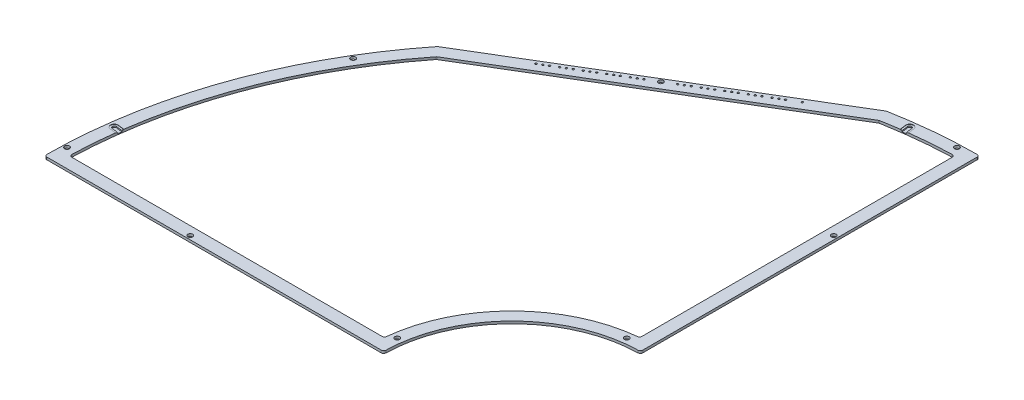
ISO-10303-21;
HEADER;
FILE_DESCRIPTION(('STEP AP214'),'2;1');
FILE_NAME('part.step','',(''),(''),'','','');
FILE_SCHEMA(('AUTOMOTIVE_DESIGN { 1 0 10303 214 1 1 1 1 }'));
ENDSEC;
DATA;
#1=APPLICATION_CONTEXT('core data for automotive mechanical design processes');
#2=APPLICATION_PROTOCOL_DEFINITION('international standard','automotive_design',2000,#1);
#3=PRODUCT_CONTEXT('',#1,'mechanical');
#4=PRODUCT('Part','Part','',(#3));
#5=PRODUCT_RELATED_PRODUCT_CATEGORY('part','',(#4));
#6=PRODUCT_DEFINITION_FORMATION('','',#4);
#7=PRODUCT_DEFINITION_CONTEXT('part definition',#1,'design');
#8=PRODUCT_DEFINITION('design','',#6,#7);
#9=PRODUCT_DEFINITION_SHAPE('','',#8);
#10=(LENGTH_UNIT() NAMED_UNIT(*) SI_UNIT(.MILLI.,.METRE.));
#11=(NAMED_UNIT(*) PLANE_ANGLE_UNIT() SI_UNIT($,.RADIAN.));
#12=(NAMED_UNIT(*) SI_UNIT($,.STERADIAN.) SOLID_ANGLE_UNIT());
#13=UNCERTAINTY_MEASURE_WITH_UNIT(LENGTH_MEASURE(1.E-05),#10,'distance_accuracy_value','');
#14=(GEOMETRIC_REPRESENTATION_CONTEXT(3) GLOBAL_UNCERTAINTY_ASSIGNED_CONTEXT((#13)) GLOBAL_UNIT_ASSIGNED_CONTEXT((#10,
#11,#12)) REPRESENTATION_CONTEXT('',''));
#15=CARTESIAN_POINT('',(0.,0.,0.));
#16=DIRECTION('',(0.,0.,1.));
#17=DIRECTION('',(1.,0.,0.));
#18=AXIS2_PLACEMENT_3D('',#15,#16,#17);
#19=CARTESIAN_POINT('',(0.,1.9812,0.));
#20=DIRECTION('',(0.,-1.,0.));
#21=DIRECTION('',(0.,0.,-1.));
#22=AXIS2_PLACEMENT_3D('',#19,#20,#21);
#23=PLANE('',#22);
#24=CARTESIAN_POINT('',(-110.321425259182,1.9812,-346.700422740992));
#25=DIRECTION('',(0.,-1.,0.));
#26=DIRECTION('',(0.,0.,-1.));
#27=AXIS2_PLACEMENT_3D('',#24,#25,#26);
#28=CIRCLE('',#27,0.749999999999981);
#29=CARTESIAN_POINT('',(-110.321425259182,1.9812,-347.450422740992));
#30=VERTEX_POINT('',#29);
#31=EDGE_CURVE('E376',#30,#30,#28,.T.);
#32=ORIENTED_EDGE('',*,*,#31,.T.);
#33=EDGE_LOOP('',(#32));
#34=FACE_BOUND('',#33,.T.);
#35=CARTESIAN_POINT('',(-173.751805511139,1.9812,-308.587605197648));
#36=DIRECTION('',(0.,-1.,0.));
#37=DIRECTION('',(0.,0.,1.));
#38=AXIS2_PLACEMENT_3D('',#35,#36,#37);
#39=CIRCLE('',#38,0.74999999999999);
#40=CARTESIAN_POINT('',(-173.751805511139,1.9812,-307.837605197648));
#41=VERTEX_POINT('',#40);
#42=EDGE_CURVE('E382',#41,#41,#39,.T.);
#43=ORIENTED_EDGE('',*,*,#42,.T.);
#44=EDGE_LOOP('',(#43));
#45=FACE_BOUND('',#44,.T.);
#46=CARTESIAN_POINT('',(-161.751463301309,1.9812,-315.798138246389));
#47=DIRECTION('',(0.,-1.,0.));
#48=DIRECTION('',(0.,0.,1.));
#49=AXIS2_PLACEMENT_3D('',#46,#47,#48);
#50=CIRCLE('',#49,0.750000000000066);
#51=CARTESIAN_POINT('',(-161.751463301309,1.9812,-315.048138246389));
#52=VERTEX_POINT('',#51);
#53=EDGE_CURVE('E388',#52,#52,#50,.T.);
#54=ORIENTED_EDGE('',*,*,#53,.T.);
#55=EDGE_LOOP('',(#54));
#56=FACE_BOUND('',#55,.T.);
#57=CARTESIAN_POINT('',(-158.322794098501,1.9812,-317.858290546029));
#58=DIRECTION('',(0.,-1.,0.));
#59=DIRECTION('',(0.,0.,1.));
#60=AXIS2_PLACEMENT_3D('',#57,#58,#59);
#61=CIRCLE('',#60,0.750000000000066);
#62=CARTESIAN_POINT('',(-158.322794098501,1.9812,-317.108290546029));
#63=VERTEX_POINT('',#62);
#64=EDGE_CURVE('E394',#63,#63,#61,.T.);
#65=ORIENTED_EDGE('',*,*,#64,.T.);
#66=EDGE_LOOP('',(#65));
#67=FACE_BOUND('',#66,.T.);
#68=CARTESIAN_POINT('',(-170.32313630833,1.9812,-310.647757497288));
#69=DIRECTION('',(0.,-1.,0.));
#70=DIRECTION('',(0.,0.,1.));
#71=AXIS2_PLACEMENT_3D('',#68,#69,#70);
#72=CIRCLE('',#71,0.750000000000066);
#73=CARTESIAN_POINT('',(-170.32313630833,1.9812,-309.897757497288));
#74=VERTEX_POINT('',#73);
#75=EDGE_CURVE('E400',#74,#74,#72,.T.);
#76=ORIENTED_EDGE('',*,*,#75,.T.);
#77=EDGE_LOOP('',(#76));
#78=FACE_BOUND('',#77,.T.);
#79=CARTESIAN_POINT('',(-166.894467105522,1.9812,-312.707909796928));
#80=DIRECTION('',(0.,-1.,0.));
#81=DIRECTION('',(0.,0.,1.));
#82=AXIS2_PLACEMENT_3D('',#79,#80,#81);
#83=CIRCLE('',#82,0.74999999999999);
#84=CARTESIAN_POINT('',(-166.894467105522,1.9812,-311.957909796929));
#85=VERTEX_POINT('',#84);
#86=EDGE_CURVE('E406',#85,#85,#83,.T.);
#87=ORIENTED_EDGE('',*,*,#86,.T.);
#88=EDGE_LOOP('',(#87));
#89=FACE_BOUND('',#88,.T.);
#90=CARTESIAN_POINT('',(-154.894124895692,1.9812,-319.918442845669));
#91=DIRECTION('',(0.,-1.,0.));
#92=DIRECTION('',(0.,0.,1.));
#93=AXIS2_PLACEMENT_3D('',#90,#91,#92);
#94=CIRCLE('',#93,0.750000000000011);
#95=CARTESIAN_POINT('',(-154.894124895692,1.9812,-319.168442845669));
#96=VERTEX_POINT('',#95);
#97=EDGE_CURVE('E412',#96,#96,#94,.T.);
#98=ORIENTED_EDGE('',*,*,#97,.T.);
#99=EDGE_LOOP('',(#98));
#100=FACE_BOUND('',#99,.T.);
#101=CARTESIAN_POINT('',(-149.751121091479,1.9812,-323.00867129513));
#102=DIRECTION('',(0.,-1.,0.));
#103=DIRECTION('',(0.,0.,1.));
#104=AXIS2_PLACEMENT_3D('',#101,#102,#103);
#105=CIRCLE('',#104,0.750000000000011);
#106=CARTESIAN_POINT('',(-149.751121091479,1.9812,-322.25867129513));
#107=VERTEX_POINT('',#106);
#108=EDGE_CURVE('E418',#107,#107,#105,.T.);
#109=ORIENTED_EDGE('',*,*,#108,.T.);
#110=EDGE_LOOP('',(#109));
#111=FACE_BOUND('',#110,.T.);
#112=CARTESIAN_POINT('',(-146.322451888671,1.9812,-325.06882359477));
#113=DIRECTION('',(0.,-1.,0.));
#114=DIRECTION('',(0.,0.,1.));
#115=AXIS2_PLACEMENT_3D('',#112,#113,#114);
#116=CIRCLE('',#115,0.750000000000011);
#117=CARTESIAN_POINT('',(-146.322451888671,1.9812,-324.31882359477));
#118=VERTEX_POINT('',#117);
#119=EDGE_CURVE('E424',#118,#118,#116,.T.);
#120=ORIENTED_EDGE('',*,*,#119,.T.);
#121=EDGE_LOOP('',(#120));
#122=FACE_BOUND('',#121,.T.);
#123=CARTESIAN_POINT('',(-142.893782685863,1.9812,-327.12897589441));
#124=DIRECTION('',(0.,-1.,0.));
#125=DIRECTION('',(0.,0.,1.));
#126=AXIS2_PLACEMENT_3D('',#123,#124,#125);
#127=CIRCLE('',#126,0.749999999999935);
#128=CARTESIAN_POINT('',(-142.893782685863,1.9812,-326.37897589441));
#129=VERTEX_POINT('',#128);
#130=EDGE_CURVE('E430',#129,#129,#127,.T.);
#131=ORIENTED_EDGE('',*,*,#130,.T.);
#132=EDGE_LOOP('',(#131));
#133=FACE_BOUND('',#132,.T.);
#134=CARTESIAN_POINT('',(-137.75077888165,1.9812,-330.219204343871));
#135=DIRECTION('',(0.,-1.,0.));
#136=DIRECTION('',(0.,0.,1.));
#137=AXIS2_PLACEMENT_3D('',#134,#135,#136);
#138=CIRCLE('',#137,0.749999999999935);
#139=CARTESIAN_POINT('',(-137.75077888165,1.9812,-329.469204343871));
#140=VERTEX_POINT('',#139);
#141=EDGE_CURVE('E436',#140,#140,#138,.T.);
#142=ORIENTED_EDGE('',*,*,#141,.T.);
#143=EDGE_LOOP('',(#142));
#144=FACE_BOUND('',#143,.T.);
#145=CARTESIAN_POINT('',(-134.322109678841,1.9812,-332.279356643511));
#146=DIRECTION('',(0.,-1.,0.));
#147=DIRECTION('',(0.,0.,1.));
#148=AXIS2_PLACEMENT_3D('',#145,#146,#147);
#149=CIRCLE('',#148,0.749999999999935);
#150=CARTESIAN_POINT('',(-134.322109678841,1.9812,-331.529356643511));
#151=VERTEX_POINT('',#150);
#152=EDGE_CURVE('E442',#151,#151,#149,.T.);
#153=ORIENTED_EDGE('',*,*,#152,.T.);
#154=EDGE_LOOP('',(#153));
#155=FACE_BOUND('',#154,.T.);
#156=CARTESIAN_POINT('',(-130.893440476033,1.9812,-334.339508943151));
#157=DIRECTION('',(0.,-1.,0.));
#158=DIRECTION('',(0.,0.,1.));
#159=AXIS2_PLACEMENT_3D('',#156,#157,#158);
#160=CIRCLE('',#159,0.749999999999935);
#161=CARTESIAN_POINT('',(-130.893440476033,1.9812,-333.589508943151));
#162=VERTEX_POINT('',#161);
#163=EDGE_CURVE('E448',#162,#162,#160,.T.);
#164=ORIENTED_EDGE('',*,*,#163,.T.);
#165=EDGE_LOOP('',(#164));
#166=FACE_BOUND('',#165,.T.);
#167=CARTESIAN_POINT('',(-125.75043667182,1.9812,-337.429737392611));
#168=DIRECTION('',(0.,-1.,0.));
#169=DIRECTION('',(0.,0.,1.));
#170=AXIS2_PLACEMENT_3D('',#167,#168,#169);
#171=CIRCLE('',#170,0.749999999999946);
#172=CARTESIAN_POINT('',(-125.75043667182,1.9812,-336.679737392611));
#173=VERTEX_POINT('',#172);
#174=EDGE_CURVE('E454',#173,#173,#171,.T.);
#175=ORIENTED_EDGE('',*,*,#174,.T.);
#176=EDGE_LOOP('',(#175));
#177=FACE_BOUND('',#176,.T.);
#178=CARTESIAN_POINT('',(-122.321767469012,1.9812,-339.489889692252));
#179=DIRECTION('',(0.,-1.,0.));
#180=DIRECTION('',(0.,0.,1.));
#181=AXIS2_PLACEMENT_3D('',#178,#179,#180);
#182=CIRCLE('',#181,0.750000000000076);
#183=CARTESIAN_POINT('',(-122.321767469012,1.9812,-338.739889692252));
#184=VERTEX_POINT('',#183);
#185=EDGE_CURVE('E460',#184,#184,#182,.T.);
#186=ORIENTED_EDGE('',*,*,#185,.T.);
#187=EDGE_LOOP('',(#186));
#188=FACE_BOUND('',#187,.T.);
#189=CARTESIAN_POINT('',(-245.753858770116,1.9812,-265.324406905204));
#190=DIRECTION('',(0.,-1.,0.));
#191=DIRECTION('',(0.,0.,-1.));
#192=AXIS2_PLACEMENT_3D('',#189,#190,#191);
#193=CIRCLE('',#192,0.750000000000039);
#194=CARTESIAN_POINT('',(-245.753858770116,1.9812,-266.074406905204));
#195=VERTEX_POINT('',#194);
#196=EDGE_CURVE('E466',#195,#195,#193,.T.);
#197=ORIENTED_EDGE('',*,*,#196,.T.);
#198=EDGE_LOOP('',(#197));
#199=FACE_BOUND('',#198,.T.);
#200=CARTESIAN_POINT('',(-242.325189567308,1.9812,-267.384559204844));
#201=DIRECTION('',(0.,-1.,0.));
#202=DIRECTION('',(0.,0.,-1.));
#203=AXIS2_PLACEMENT_3D('',#200,#201,#202);
#204=CIRCLE('',#203,0.750000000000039);
#205=CARTESIAN_POINT('',(-242.325189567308,1.9812,-268.134559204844));
#206=VERTEX_POINT('',#205);
#207=EDGE_CURVE('E472',#206,#206,#204,.T.);
#208=ORIENTED_EDGE('',*,*,#207,.T.);
#209=EDGE_LOOP('',(#208));
#210=FACE_BOUND('',#209,.T.);
#211=CARTESIAN_POINT('',(-238.896520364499,1.9812,-269.444711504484));
#212=DIRECTION('',(0.,-1.,0.));
#213=DIRECTION('',(0.,0.,-1.));
#214=AXIS2_PLACEMENT_3D('',#211,#212,#213);
#215=CIRCLE('',#214,0.749999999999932);
#216=CARTESIAN_POINT('',(-238.896520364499,1.9812,-270.194711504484));
#217=VERTEX_POINT('',#216);
#218=EDGE_CURVE('E478',#217,#217,#215,.T.);
#219=ORIENTED_EDGE('',*,*,#218,.T.);
#220=EDGE_LOOP('',(#219));
#221=FACE_BOUND('',#220,.T.);
#222=CARTESIAN_POINT('',(-233.753516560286,1.9812,-272.534939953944));
#223=DIRECTION('',(0.,-1.,0.));
#224=DIRECTION('',(0.,0.,-1.));
#225=AXIS2_PLACEMENT_3D('',#222,#223,#224);
#226=CIRCLE('',#225,0.749999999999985);
#227=CARTESIAN_POINT('',(-233.753516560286,1.9812,-273.284939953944));
#228=VERTEX_POINT('',#227);
#229=EDGE_CURVE('E484',#228,#228,#226,.T.);
#230=ORIENTED_EDGE('',*,*,#229,.T.);
#231=EDGE_LOOP('',(#230));
#232=FACE_BOUND('',#231,.T.);
#233=CARTESIAN_POINT('',(-230.324847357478,1.9812,-274.595092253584));
#234=DIRECTION('',(0.,-1.,0.));
#235=DIRECTION('',(0.,0.,-1.));
#236=AXIS2_PLACEMENT_3D('',#233,#234,#235);
#237=CIRCLE('',#236,0.749999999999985);
#238=CARTESIAN_POINT('',(-230.324847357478,1.9812,-275.345092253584));
#239=VERTEX_POINT('',#238);
#240=EDGE_CURVE('E490',#239,#239,#237,.T.);
#241=ORIENTED_EDGE('',*,*,#240,.T.);
#242=EDGE_LOOP('',(#241));
#243=FACE_BOUND('',#242,.T.);
#244=CARTESIAN_POINT('',(-226.896178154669,1.9812,-276.655244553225));
#245=DIRECTION('',(0.,-1.,0.));
#246=DIRECTION('',(0.,0.,-1.));
#247=AXIS2_PLACEMENT_3D('',#244,#245,#246);
#248=CIRCLE('',#247,0.749999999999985);
#249=CARTESIAN_POINT('',(-226.896178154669,1.9812,-277.405244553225));
#250=VERTEX_POINT('',#249);
#251=EDGE_CURVE('E496',#250,#250,#248,.T.);
#252=ORIENTED_EDGE('',*,*,#251,.T.);
#253=EDGE_LOOP('',(#252));
#254=FACE_BOUND('',#253,.T.);
#255=CARTESIAN_POINT('',(-221.753174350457,1.9812,-279.745473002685));
#256=DIRECTION('',(0.,-1.,0.));
#257=DIRECTION('',(0.,0.,-1.));
#258=AXIS2_PLACEMENT_3D('',#255,#256,#257);
#259=CIRCLE('',#258,0.749999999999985);
#260=CARTESIAN_POINT('',(-221.753174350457,1.9812,-280.495473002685));
#261=VERTEX_POINT('',#260);
#262=EDGE_CURVE('E502',#261,#261,#259,.T.);
#263=ORIENTED_EDGE('',*,*,#262,.T.);
#264=EDGE_LOOP('',(#263));
#265=FACE_BOUND('',#264,.T.);
#266=CARTESIAN_POINT('',(-218.324505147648,1.9812,-281.805625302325));
#267=DIRECTION('',(0.,-1.,0.));
#268=DIRECTION('',(0.,0.,-1.));
#269=AXIS2_PLACEMENT_3D('',#266,#267,#268);
#270=CIRCLE('',#269,0.749999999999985);
#271=CARTESIAN_POINT('',(-218.324505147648,1.9812,-282.555625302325));
#272=VERTEX_POINT('',#271);
#273=EDGE_CURVE('E508',#272,#272,#270,.T.);
#274=ORIENTED_EDGE('',*,*,#273,.T.);
#275=EDGE_LOOP('',(#274));
#276=FACE_BOUND('',#275,.T.);
#277=CARTESIAN_POINT('',(-214.89583594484,1.9812,-283.865777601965));
#278=DIRECTION('',(0.,-1.,0.));
#279=DIRECTION('',(0.,0.,-1.));
#280=AXIS2_PLACEMENT_3D('',#277,#278,#279);
#281=CIRCLE('',#280,0.749999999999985);
#282=CARTESIAN_POINT('',(-214.89583594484,1.9812,-284.615777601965));
#283=VERTEX_POINT('',#282);
#284=EDGE_CURVE('E514',#283,#283,#281,.T.);
#285=ORIENTED_EDGE('',*,*,#284,.T.);
#286=EDGE_LOOP('',(#285));
#287=FACE_BOUND('',#286,.T.);
#288=CARTESIAN_POINT('',(-209.752832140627,1.9812,-286.956006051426));
#289=DIRECTION('',(0.,-1.,0.));
#290=DIRECTION('',(0.,0.,-1.));
#291=AXIS2_PLACEMENT_3D('',#288,#289,#290);
#292=CIRCLE('',#291,0.749999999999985);
#293=CARTESIAN_POINT('',(-209.752832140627,1.9812,-287.706006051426));
#294=VERTEX_POINT('',#293);
#295=EDGE_CURVE('E520',#294,#294,#292,.T.);
#296=ORIENTED_EDGE('',*,*,#295,.T.);
#297=EDGE_LOOP('',(#296));
#298=FACE_BOUND('',#297,.T.);
#299=CARTESIAN_POINT('',(-197.752489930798,1.9812,-294.166539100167));
#300=DIRECTION('',(0.,-1.,0.));
#301=DIRECTION('',(0.,0.,-1.));
#302=AXIS2_PLACEMENT_3D('',#299,#300,#301);
#303=CIRCLE('',#302,0.749999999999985);
#304=CARTESIAN_POINT('',(-197.752489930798,1.9812,-294.916539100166));
#305=VERTEX_POINT('',#304);
#306=EDGE_CURVE('E526',#305,#305,#303,.T.);
#307=ORIENTED_EDGE('',*,*,#306,.T.);
#308=EDGE_LOOP('',(#307));
#309=FACE_BOUND('',#308,.T.);
#310=CARTESIAN_POINT('',(-194.323820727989,1.9812,-296.226691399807));
#311=DIRECTION('',(0.,-1.,0.));
#312=DIRECTION('',(0.,0.,-1.));
#313=AXIS2_PLACEMENT_3D('',#310,#311,#312);
#314=CIRCLE('',#313,0.749999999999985);
#315=CARTESIAN_POINT('',(-194.323820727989,1.9812,-296.976691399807));
#316=VERTEX_POINT('',#315);
#317=EDGE_CURVE('E532',#316,#316,#314,.T.);
#318=ORIENTED_EDGE('',*,*,#317,.T.);
#319=EDGE_LOOP('',(#318));
#320=FACE_BOUND('',#319,.T.);
#321=CARTESIAN_POINT('',(-206.324162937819,1.9812,-289.016158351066));
#322=DIRECTION('',(0.,-1.,0.));
#323=DIRECTION('',(0.,0.,-1.));
#324=AXIS2_PLACEMENT_3D('',#321,#322,#323);
#325=CIRCLE('',#324,0.749999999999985);
#326=CARTESIAN_POINT('',(-206.324162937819,1.9812,-289.766158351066));
#327=VERTEX_POINT('',#326);
#328=EDGE_CURVE('E538',#327,#327,#325,.T.);
#329=ORIENTED_EDGE('',*,*,#328,.T.);
#330=EDGE_LOOP('',(#329));
#331=FACE_BOUND('',#330,.T.);
#332=CARTESIAN_POINT('',(-202.89549373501,1.9812,-291.076310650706));
#333=DIRECTION('',(0.,-1.,0.));
#334=DIRECTION('',(0.,0.,-1.));
#335=AXIS2_PLACEMENT_3D('',#332,#333,#334);
#336=CIRCLE('',#335,0.749999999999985);
#337=CARTESIAN_POINT('',(-202.89549373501,1.9812,-291.826310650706));
#338=VERTEX_POINT('',#337);
#339=EDGE_CURVE('E544',#338,#338,#336,.T.);
#340=ORIENTED_EDGE('',*,*,#339,.T.);
#341=EDGE_LOOP('',(#340));
#342=FACE_BOUND('',#341,.T.);
#343=CARTESIAN_POINT('',(-118.893098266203,1.9812,-341.550041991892));
#344=DIRECTION('',(0.,-1.,0.));
#345=DIRECTION('',(0.,0.,1.));
#346=AXIS2_PLACEMENT_3D('',#343,#344,#345);
#347=CIRCLE('',#346,0.75);
#348=CARTESIAN_POINT('',(-118.893098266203,1.9812,-340.800041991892));
#349=VERTEX_POINT('',#348);
#350=EDGE_CURVE('E550',#349,#349,#347,.T.);
#351=ORIENTED_EDGE('',*,*,#350,.T.);
#352=EDGE_LOOP('',(#351));
#353=FACE_BOUND('',#352,.T.);
#354=CARTESIAN_POINT('',(-190.895151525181,1.9812,-298.286843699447));
#355=DIRECTION('',(0.,-1.,0.));
#356=DIRECTION('',(0.,0.,-1.));
#357=AXIS2_PLACEMENT_3D('',#354,#355,#356);
#358=CIRCLE('',#357,0.749999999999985);
#359=CARTESIAN_POINT('',(-190.895151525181,1.9812,-299.036843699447));
#360=VERTEX_POINT('',#359);
#361=EDGE_CURVE('E556',#360,#360,#358,.T.);
#362=ORIENTED_EDGE('',*,*,#361,.T.);
#363=EDGE_LOOP('',(#362));
#364=FACE_BOUND('',#363,.T.);
#365=CARTESIAN_POINT('',(-3.49999999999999,1.9812,-265.406923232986));
#366=DIRECTION('',(0.,1.,0.));
#367=DIRECTION('',(0.,0.,1.));
#368=AXIS2_PLACEMENT_3D('',#365,#366,#367);
#369=CIRCLE('',#368,1.99999999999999);
#370=CARTESIAN_POINT('',(-3.49999999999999,1.9812,-263.406923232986));
#371=VERTEX_POINT('',#370);
#372=EDGE_CURVE('E568',#371,#371,#369,.T.);
#373=ORIENTED_EDGE('',*,*,#372,.F.);
#374=EDGE_LOOP('',(#373));
#375=FACE_BOUND('',#374,.T.);
#376=CARTESIAN_POINT('',(-15.5,1.9812,-108.90247931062));
#377=DIRECTION('',(0.,1.,0.));
#378=DIRECTION('',(0.,0.,1.));
#379=AXIS2_PLACEMENT_3D('',#376,#377,#378);
#380=CIRCLE('',#379,2.);
#381=CARTESIAN_POINT('',(-15.5,1.9812,-106.90247931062));
#382=VERTEX_POINT('',#381);
#383=EDGE_CURVE('E580',#382,#382,#380,.T.);
#384=ORIENTED_EDGE('',*,*,#383,.F.);
#385=EDGE_LOOP('',(#384));
#386=FACE_BOUND('',#385,.T.);
#387=CARTESIAN_POINT('',(-108.90247931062,1.9812,-15.5));
#388=DIRECTION('',(0.,1.,0.));
#389=DIRECTION('',(0.,0.,1.));
#390=AXIS2_PLACEMENT_3D('',#387,#388,#389);
#391=CIRCLE('',#390,1.99999999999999);
#392=CARTESIAN_POINT('',(-108.90247931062,1.9812,-13.5));
#393=VERTEX_POINT('',#392);
#394=EDGE_CURVE('E592',#393,#393,#391,.T.);
#395=ORIENTED_EDGE('',*,*,#394,.F.);
#396=EDGE_LOOP('',(#395));
#397=FACE_BOUND('',#396,.T.);
#398=CARTESIAN_POINT('',(-377.682075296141,1.9812,-15.4999999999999));
#399=DIRECTION('',(0.,1.,0.));
#400=DIRECTION('',(0.,0.,1.));
#401=AXIS2_PLACEMENT_3D('',#398,#399,#400);
#402=CIRCLE('',#401,2.00000000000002);
#403=CARTESIAN_POINT('',(-377.682075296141,1.9812,-13.4999999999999));
#404=VERTEX_POINT('',#403);
#405=EDGE_CURVE('E604',#404,#404,#402,.T.);
#406=ORIENTED_EDGE('',*,*,#405,.F.);
#407=EDGE_LOOP('',(#406));
#408=FACE_BOUND('',#407,.T.);
#409=CARTESIAN_POINT('',(0.,1.9812,0.));
#410=DIRECTION('',(0.,1.,0.));
#411=DIRECTION('',(0.,0.,-1.));
#412=AXIS2_PLACEMENT_3D('',#409,#410,#411);
#413=CIRCLE('',#412,381.);
#414=CARTESIAN_POINT('',(-297.945935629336,1.9812,-237.464143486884));
#415=VERTEX_POINT('',#414);
#416=CARTESIAN_POINT('',(-380.991711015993,1.9812,-2.51319261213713));
#417=VERTEX_POINT('',#416);
#418=EDGE_CURVE('E706',#415,#417,#413,.T.);
#419=ORIENTED_EDGE('',*,*,#418,.T.);
#420=CARTESIAN_POINT('',(-378.991754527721,1.9812,-2.49999999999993));
#421=DIRECTION('',(0.,-1.,0.));
#422=DIRECTION('',(0.,0.,-1.));
#423=AXIS2_PLACEMENT_3D('',#420,#421,#422);
#424=CIRCLE('',#423,2.);
#425=CARTESIAN_POINT('',(-378.991754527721,1.9812,-0.499999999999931));
#426=VERTEX_POINT('',#425);
#427=EDGE_CURVE('E780',#417,#426,#424,.F.);
#428=ORIENTED_EDGE('',*,*,#427,.T.);
#429=DIRECTION('',(1.,0.,0.));
#430=VECTOR('',#429,1.);
#431=CARTESIAN_POINT('',(-104.998809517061,1.9812,-0.499999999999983));
#432=LINE('',#431,#430);
#433=CARTESIAN_POINT('',(-106.970790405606,1.9812,-0.499999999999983));
#434=VERTEX_POINT('',#433);
#435=EDGE_CURVE('E709',#426,#434,#432,.T.);
#436=ORIENTED_EDGE('',*,*,#435,.T.);
#437=CARTESIAN_POINT('',(-106.970790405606,1.9812,-2.49999999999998));
#438=DIRECTION('',(0.,-1.,0.));
#439=DIRECTION('',(0.,0.,-1.));
#440=AXIS2_PLACEMENT_3D('',#437,#438,#439);
#441=CIRCLE('',#440,2.);
#442=CARTESIAN_POINT('',(-104.971336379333,1.9812,-2.45327102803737));
#443=VERTEX_POINT('',#442);
#444=EDGE_CURVE('E775',#434,#443,#441,.F.);
#445=ORIENTED_EDGE('',*,*,#444,.T.);
#446=CARTESIAN_POINT('',(0.,1.9812,0.));
#447=DIRECTION('',(0.,-1.,0.));
#448=DIRECTION('',(0.,0.,-1.));
#449=AXIS2_PLACEMENT_3D('',#446,#447,#448);
#450=CIRCLE('',#449,105.);
#451=CARTESIAN_POINT('',(-2.45327102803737,1.9812,-104.971336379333));
#452=VERTEX_POINT('',#451);
#453=EDGE_CURVE('E712',#443,#452,#450,.T.);
#454=ORIENTED_EDGE('',*,*,#453,.T.);
#455=CARTESIAN_POINT('',(-2.49999999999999,1.9812,-106.970790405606));
#456=DIRECTION('',(0.,-1.,0.));
#457=DIRECTION('',(0.,0.,-1.));
#458=AXIS2_PLACEMENT_3D('',#455,#456,#457);
#459=CIRCLE('',#458,2.);
#460=CARTESIAN_POINT('',(-0.499999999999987,1.9812,-106.970790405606));
#461=VERTEX_POINT('',#460);
#462=EDGE_CURVE('E53',#452,#461,#459,.F.);
#463=ORIENTED_EDGE('',*,*,#462,.T.);
#464=DIRECTION('',(0.,0.,-1.));
#465=VECTOR('',#464,1.);
#466=CARTESIAN_POINT('',(-0.499999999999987,1.9812,-104.998809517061));
#467=LINE('',#466,#465);
#468=CARTESIAN_POINT('',(-0.5,1.9812,-378.991754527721));
#469=VERTEX_POINT('',#468);
#470=EDGE_CURVE('E714',#461,#469,#467,.T.);
#471=ORIENTED_EDGE('',*,*,#470,.T.);
#472=CARTESIAN_POINT('',(-2.5,1.9812,-378.991754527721));
#473=DIRECTION('',(0.,-1.,0.));
#474=DIRECTION('',(0.,0.,-1.));
#475=AXIS2_PLACEMENT_3D('',#472,#473,#474);
#476=CIRCLE('',#475,2.);
#477=CARTESIAN_POINT('',(-2.5131926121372,1.9812,-380.991711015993));
#478=VERTEX_POINT('',#477);
#479=EDGE_CURVE('E778',#469,#478,#476,.F.);
#480=ORIENTED_EDGE('',*,*,#479,.T.);
#481=CARTESIAN_POINT('',(0.,1.9812,0.));
#482=DIRECTION('',(0.,1.,0.));
#483=DIRECTION('',(0.,0.,-1.));
#484=AXIS2_PLACEMENT_3D('',#481,#482,#483);
#485=CIRCLE('',#484,381.);
#486=CARTESIAN_POINT('',(-69.7912498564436,1.9812,-374.553309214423));
#487=VERTEX_POINT('',#486);
#488=EDGE_CURVE('E701',#478,#487,#485,.T.);
#489=ORIENTED_EDGE('',*,*,#488,.T.);
#490=DIRECTION('',(-0.857167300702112,0.,0.515038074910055));
#491=VECTOR('',#490,1.);
#492=CARTESIAN_POINT('',(-69.7912498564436,1.9812,-374.553309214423));
#493=LINE('',#492,#491);
#494=EDGE_CURVE('E703',#487,#415,#493,.T.);
#495=ORIENTED_EDGE('',*,*,#494,.T.);
#496=EDGE_LOOP('',(#419,#428,#436,#445,#454,#463,#471,#480,#489,#495));
#497=FACE_BOUND('',#496,.T.);
#498=CARTESIAN_POINT('',(-324.009239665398,1.9812,-194.684392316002));
#499=DIRECTION('',(0.,1.,0.));
#500=DIRECTION('',(0.,0.,1.));
#501=AXIS2_PLACEMENT_3D('',#498,#499,#500);
#502=CIRCLE('',#501,1.99999999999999);
#503=CARTESIAN_POINT('',(-324.009239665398,1.9812,-192.684392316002));
#504=VERTEX_POINT('',#503);
#505=EDGE_CURVE('E598',#504,#504,#502,.T.);
#506=ORIENTED_EDGE('',*,*,#505,.F.);
#507=EDGE_LOOP('',(#506));
#508=FACE_BOUND('',#507,.T.);
#509=CARTESIAN_POINT('',(-182.32347851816,1.9812,-303.437224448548));
#510=DIRECTION('',(0.,1.,0.));
#511=DIRECTION('',(0.,0.,1.));
#512=AXIS2_PLACEMENT_3D('',#509,#510,#511);
#513=CIRCLE('',#512,1.99999999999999);
#514=CARTESIAN_POINT('',(-182.32347851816,1.9812,-301.437224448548));
#515=VERTEX_POINT('',#514);
#516=EDGE_CURVE('E586',#515,#515,#513,.T.);
#517=ORIENTED_EDGE('',*,*,#516,.F.);
#518=EDGE_LOOP('',(#517));
#519=FACE_BOUND('',#518,.T.);
#520=CARTESIAN_POINT('',(-15.5,1.9812,-377.682075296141));
#521=DIRECTION('',(0.,1.,0.));
#522=DIRECTION('',(0.,0.,1.));
#523=AXIS2_PLACEMENT_3D('',#520,#521,#522);
#524=CIRCLE('',#523,1.99999999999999);
#525=CARTESIAN_POINT('',(-15.5,1.9812,-375.682075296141));
#526=VERTEX_POINT('',#525);
#527=EDGE_CURVE('E574',#526,#526,#524,.T.);
#528=ORIENTED_EDGE('',*,*,#527,.F.);
#529=EDGE_LOOP('',(#528));
#530=FACE_BOUND('',#529,.T.);
#531=CARTESIAN_POINT('',(-265.406923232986,1.9812,-3.49999999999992));
#532=DIRECTION('',(0.,1.,0.));
#533=DIRECTION('',(0.,0.,1.));
#534=AXIS2_PLACEMENT_3D('',#531,#532,#533);
#535=CIRCLE('',#534,1.99999999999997);
#536=CARTESIAN_POINT('',(-265.406923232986,1.9812,-1.49999999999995));
#537=VERTEX_POINT('',#536);
#538=EDGE_CURVE('E562',#537,#537,#535,.T.);
#539=ORIENTED_EDGE('',*,*,#538,.F.);
#540=EDGE_LOOP('',(#539));
#541=FACE_BOUND('',#540,.T.);
#542=DIRECTION('',(-0.130526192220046,0.,-0.991444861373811));
#543=VECTOR('',#542,1.);
#544=CARTESIAN_POINT('',(-30927.5547607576,1.9812,-234895.11737784));
#545=LINE('',#544,#543);
#546=CARTESIAN_POINT('',(-51.3979686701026,1.9812,-367.422439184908));
#547=VERTEX_POINT('',#546);
#548=CARTESIAN_POINT('',(-52.052182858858,1.9812,-372.391689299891));
#549=VERTEX_POINT('',#548);
#550=EDGE_CURVE('E313',#547,#549,#545,.T.);
#551=ORIENTED_EDGE('',*,*,#550,.T.);
#552=CARTESIAN_POINT('',(-49.0778482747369,1.9812,-372.783267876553));
#553=DIRECTION('',(0.,1.,0.));
#554=DIRECTION('',(0.,0.,1.));
#555=AXIS2_PLACEMENT_3D('',#552,#553,#554);
#556=CIRCLE('',#555,2.99999999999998);
#557=CARTESIAN_POINT('',(-46.1035136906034,1.9812,-373.174846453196));
#558=VERTEX_POINT('',#557);
#559=EDGE_CURVE('E325',#558,#549,#556,.T.);
#560=ORIENTED_EDGE('',*,*,#559,.F.);
#561=DIRECTION('',(-0.130526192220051,0.,-0.99144486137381));
#562=VECTOR('',#561,1.);
#563=CARTESIAN_POINT('',(-30921.6060915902,1.9812,-234895.900534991));
#564=LINE('',#563,#562);
#565=CARTESIAN_POINT('',(-45.4492995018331,1.9812,-368.205596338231));
#566=VERTEX_POINT('',#565);
#567=EDGE_CURVE('E317',#566,#558,#564,.T.);
#568=ORIENTED_EDGE('',*,*,#567,.F.);
#569=CARTESIAN_POINT('',(0.,1.9812,0.));
#570=DIRECTION('',(0.,1.,0.));
#571=DIRECTION('',(0.,0.,-1.));
#572=AXIS2_PLACEMENT_3D('',#569,#570,#571);
#573=CIRCLE('',#572,371.);
#574=CARTESIAN_POINT('',(-12.567750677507,1.9812,-370.787070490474));
#575=VERTEX_POINT('',#574);
#576=EDGE_CURVE('E626',#575,#566,#573,.T.);
#577=ORIENTED_EDGE('',*,*,#576,.F.);
#578=CARTESIAN_POINT('',(-12.5,1.9812,-368.78821835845));
#579=DIRECTION('',(0.,1.,0.));
#580=DIRECTION('',(0.,0.,1.));
#581=AXIS2_PLACEMENT_3D('',#578,#579,#580);
#582=CIRCLE('',#581,2.00000000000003);
#583=CARTESIAN_POINT('',(-10.5,1.9812,-368.78821835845));
#584=VERTEX_POINT('',#583);
#585=EDGE_CURVE('E623',#584,#575,#582,.T.);
#586=ORIENTED_EDGE('',*,*,#585,.F.);
#587=DIRECTION('',(0.,0.,-1.));
#588=VECTOR('',#587,1.);
#589=CARTESIAN_POINT('',(-10.5,1.9812,-116.330348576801));
#590=LINE('',#589,#588);
#591=CARTESIAN_POINT('',(-10.5,1.9812,-116.330348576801));
#592=VERTEX_POINT('',#591);
#593=EDGE_CURVE('E621',#592,#584,#590,.T.);
#594=ORIENTED_EDGE('',*,*,#593,.F.);
#595=CARTESIAN_POINT('',(-12.5,1.9812,-116.330348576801));
#596=DIRECTION('',(0.,1.,0.));
#597=DIRECTION('',(0.,0.,1.));
#598=AXIS2_PLACEMENT_3D('',#595,#596,#597);
#599=CIRCLE('',#598,2.);
#600=CARTESIAN_POINT('',(-12.2863247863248,1.9812,-114.341795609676));
#601=VERTEX_POINT('',#600);
#602=EDGE_CURVE('E619',#601,#592,#599,.T.);
#603=ORIENTED_EDGE('',*,*,#602,.F.);
#604=CARTESIAN_POINT('',(0.,1.9812,0.));
#605=DIRECTION('',(0.,-1.,0.));
#606=DIRECTION('',(0.,0.,-1.));
#607=AXIS2_PLACEMENT_3D('',#604,#605,#606);
#608=CIRCLE('',#607,115.);
#609=CARTESIAN_POINT('',(-114.341795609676,1.9812,-12.2863247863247));
#610=VERTEX_POINT('',#609);
#611=EDGE_CURVE('E617',#610,#601,#608,.T.);
#612=ORIENTED_EDGE('',*,*,#611,.F.);
#613=CARTESIAN_POINT('',(-116.330348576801,1.9812,-12.5));
#614=DIRECTION('',(0.,1.,0.));
#615=DIRECTION('',(0.,0.,1.));
#616=AXIS2_PLACEMENT_3D('',#613,#614,#615);
#617=CIRCLE('',#616,2.00000000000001);
#618=CARTESIAN_POINT('',(-116.330348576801,1.9812,-10.5));
#619=VERTEX_POINT('',#618);
#620=EDGE_CURVE('E615',#619,#610,#617,.T.);
#621=ORIENTED_EDGE('',*,*,#620,.F.);
#622=DIRECTION('',(1.,0.,0.));
#623=VECTOR('',#622,1.);
#624=CARTESIAN_POINT('',(-116.330348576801,1.9812,-10.5));
#625=LINE('',#624,#623);
#626=CARTESIAN_POINT('',(-368.78821835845,1.9812,-10.4999999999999));
#627=VERTEX_POINT('',#626);
#628=EDGE_CURVE('E612',#627,#619,#625,.T.);
#629=ORIENTED_EDGE('',*,*,#628,.F.);
#630=CARTESIAN_POINT('',(-368.78821835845,1.9812,-12.4999999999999));
#631=DIRECTION('',(0.,1.,0.));
#632=DIRECTION('',(0.,0.,1.));
#633=AXIS2_PLACEMENT_3D('',#630,#631,#632);
#634=CIRCLE('',#633,2.);
#635=CARTESIAN_POINT('',(-370.787070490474,1.9812,-12.5677506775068));
#636=VERTEX_POINT('',#635);
#637=EDGE_CURVE('E610',#636,#627,#634,.T.);
#638=ORIENTED_EDGE('',*,*,#637,.F.);
#639=CARTESIAN_POINT('',(0.,1.9812,0.));
#640=DIRECTION('',(0.,1.,0.));
#641=DIRECTION('',(0.,0.,-1.));
#642=AXIS2_PLACEMENT_3D('',#639,#640,#641);
#643=CIRCLE('',#642,371.);
#644=CARTESIAN_POINT('',(-368.205596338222,1.9812,-45.4492995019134));
#645=VERTEX_POINT('',#644);
#646=EDGE_CURVE('E636',#645,#636,#643,.T.);
#647=ORIENTED_EDGE('',*,*,#646,.F.);
#648=DIRECTION('',(-0.991444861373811,0.,-0.130526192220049));
#649=VECTOR('',#648,1.);
#650=CARTESIAN_POINT('',(355315.073950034,1.9812,46781.1428028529));
#651=LINE('',#650,#649);
#652=CARTESIAN_POINT('',(-373.174846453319,1.9812,-46.1035136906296));
#653=VERTEX_POINT('',#652);
#654=EDGE_CURVE('E355',#645,#653,#651,.T.);
#655=ORIENTED_EDGE('',*,*,#654,.T.);
#656=CARTESIAN_POINT('',(-372.783267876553,1.9812,-49.077848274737));
#657=DIRECTION('',(0.,1.,0.));
#658=DIRECTION('',(0.,0.,1.));
#659=AXIS2_PLACEMENT_3D('',#656,#657,#658);
#660=CIRCLE('',#659,2.99999999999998);
#661=CARTESIAN_POINT('',(-372.391689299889,1.9812,-52.0521828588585));
#662=VERTEX_POINT('',#661);
#663=EDGE_CURVE('E367',#662,#653,#660,.T.);
#664=ORIENTED_EDGE('',*,*,#663,.F.);
#665=DIRECTION('',(-0.991444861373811,0.,-0.130526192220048));
#666=VECTOR('',#665,1.);
#667=CARTESIAN_POINT('',(355315.857107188,1.9812,46775.1941336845));
#668=LINE('',#667,#666);
#669=CARTESIAN_POINT('',(-367.42243918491,1.9812,-51.3979686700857));
#670=VERTEX_POINT('',#669);
#671=EDGE_CURVE('E359',#670,#662,#668,.T.);
#672=ORIENTED_EDGE('',*,*,#671,.F.);
#673=CARTESIAN_POINT('',(-291.466479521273,1.9812,-229.539302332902));
#674=VERTEX_POINT('',#673);
#675=EDGE_CURVE('E637',#674,#670,#643,.T.);
#676=ORIENTED_EDGE('',*,*,#675,.F.);
#677=CARTESIAN_POINT('',(-289.895231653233,1.9812,-228.301893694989));
#678=DIRECTION('',(0.,1.,0.));
#679=DIRECTION('',(0.,0.,1.));
#680=AXIS2_PLACEMENT_3D('',#677,#678,#679);
#681=CIRCLE('',#680,2.00000000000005);
#682=CARTESIAN_POINT('',(-290.925307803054,1.9812,-230.016228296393));
#683=VERTEX_POINT('',#682);
#684=EDGE_CURVE('E633',#683,#674,#681,.T.);
#685=ORIENTED_EDGE('',*,*,#684,.F.);
#686=DIRECTION('',(-0.857167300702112,0.,0.515038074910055));
#687=VECTOR('',#686,1.);
#688=CARTESIAN_POINT('',(-66.511116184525,1.9812,-364.857878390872));
#689=LINE('',#688,#687);
#690=CARTESIAN_POINT('',(-66.511116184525,1.9812,-364.857878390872));
#691=VERTEX_POINT('',#690);
#692=EDGE_CURVE('E631',#691,#683,#689,.T.);
#693=ORIENTED_EDGE('',*,*,#692,.F.);
#694=CARTESIAN_POINT('',(-65.4810400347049,1.9812,-363.143543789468));
#695=DIRECTION('',(0.,1.,0.));
#696=DIRECTION('',(0.,0.,1.));
#697=AXIS2_PLACEMENT_3D('',#694,#695,#696);
#698=CIRCLE('',#697,2.00000000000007);
#699=CARTESIAN_POINT('',(-65.8359508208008,1.9812,-365.111801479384));
#700=VERTEX_POINT('',#699);
#701=EDGE_CURVE('E629',#700,#691,#698,.T.);
#702=ORIENTED_EDGE('',*,*,#701,.F.);
#703=EDGE_CURVE('E625',#547,#700,#573,.T.);
#704=ORIENTED_EDGE('',*,*,#703,.F.);
#705=EDGE_LOOP('',(#551,#560,#568,#577,#586,#594,#603,#612,#621,#629,#638,#647,#655,#664,#672,
#676,#685,#693,#702,#704));
#706=FACE_BOUND('',#705,.T.);
#707=ADVANCED_FACE('F31',(#34,#45,#56,#67,#78,#89,#100,#111,#122,#133,#144,#155,#166,#177,#188,
#199,#210,#221,#232,#243,#254,#265,#276,#287,#298,#309,#320,#331,#342,#353,#364,#375,#386,#397,
#408,#497,#508,#519,#530,#541,#706),#23,.F.);
#708=CARTESIAN_POINT('',(0.,1.9812,0.));
#709=DIRECTION('',(0.,-1.,0.));
#710=DIRECTION('',(0.,0.,-1.));
#711=AXIS2_PLACEMENT_3D('',#708,#709,#710);
#712=CYLINDRICAL_SURFACE('',#711,371.);
#713=DIRECTION('',(0.,-1.,0.));
#714=VECTOR('',#713,1.);
#715=CARTESIAN_POINT('',(-46.8483752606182,1.9812,-368.030202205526));
#716=LINE('',#715,#714);
#717=CARTESIAN_POINT('',(-46.8483752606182,0.7312,-368.030202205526));
#718=VERTEX_POINT('',#717);
#719=CARTESIAN_POINT('',(-46.8483752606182,1.7312,-368.030202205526));
#720=VERTEX_POINT('',#719);
#721=EDGE_CURVE('E311',#718,#720,#716,.F.);
#722=ORIENTED_EDGE('',*,*,#721,.F.);
#723=CARTESIAN_POINT('',(0.,0.7312,0.));
#724=DIRECTION('',(0.,1.,0.));
#725=DIRECTION('',(0.,0.,1.));
#726=AXIS2_PLACEMENT_3D('',#723,#724,#725);
#727=CIRCLE('',#726,371.);
#728=CARTESIAN_POINT('',(-50.0011699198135,0.7312,-367.615128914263));
#729=VERTEX_POINT('',#728);
#730=EDGE_CURVE('E284',#718,#729,#727,.T.);
#731=ORIENTED_EDGE('',*,*,#730,.T.);
#732=DIRECTION('',(0.,-1.,0.));
#733=VECTOR('',#732,1.);
#734=CARTESIAN_POINT('',(-50.0011699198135,1.9812,-367.615128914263));
#735=LINE('',#734,#733);
#736=CARTESIAN_POINT('',(-50.0011699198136,1.7312,-367.615128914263));
#737=VERTEX_POINT('',#736);
#738=EDGE_CURVE('E308',#737,#729,#735,.T.);
#739=ORIENTED_EDGE('',*,*,#738,.F.);
#740=CARTESIAN_POINT('',(0.,1.7312,0.));
#741=DIRECTION('',(0.,1.,0.));
#742=DIRECTION('',(0.,0.,1.));
#743=AXIS2_PLACEMENT_3D('',#740,#741,#742);
#744=CIRCLE('',#743,371.);
#745=CARTESIAN_POINT('',(-51.3979686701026,1.7312,-367.422439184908));
#746=VERTEX_POINT('',#745);
#747=EDGE_CURVE('E749',#737,#746,#744,.T.);
#748=ORIENTED_EDGE('',*,*,#747,.T.);
#749=DIRECTION('',(0.,-1.,0.));
#750=VECTOR('',#749,1.);
#751=CARTESIAN_POINT('',(-51.3979686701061,1.9812,-367.422439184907));
#752=LINE('',#751,#750);
#753=EDGE_CURVE('E755',#746,#547,#752,.F.);
#754=ORIENTED_EDGE('',*,*,#753,.T.);
#755=ORIENTED_EDGE('',*,*,#703,.T.);
#756=DIRECTION('',(0.,-1.,0.));
#757=VECTOR('',#756,1.);
#758=CARTESIAN_POINT('',(-65.8359508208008,1.9812,-365.111801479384));
#759=LINE('',#758,#757);
#760=CARTESIAN_POINT('',(-65.8359508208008,0.,-365.111801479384));
#761=VERTEX_POINT('',#760);
#762=EDGE_CURVE('E683',#700,#761,#759,.T.);
#763=ORIENTED_EDGE('',*,*,#762,.T.);
#764=CARTESIAN_POINT('',(0.,0.,0.));
#765=DIRECTION('',(0.,1.,0.));
#766=DIRECTION('',(0.,0.,-1.));
#767=AXIS2_PLACEMENT_3D('',#764,#765,#766);
#768=CIRCLE('',#767,371.);
#769=CARTESIAN_POINT('',(-12.567750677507,0.,-370.787070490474));
#770=VERTEX_POINT('',#769);
#771=EDGE_CURVE('E661',#770,#761,#768,.T.);
#772=ORIENTED_EDGE('',*,*,#771,.F.);
#773=DIRECTION('',(0.,-1.,0.));
#774=VECTOR('',#773,1.);
#775=CARTESIAN_POINT('',(-12.567750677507,1.9812,-370.787070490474));
#776=LINE('',#775,#774);
#777=EDGE_CURVE('E685',#575,#770,#776,.T.);
#778=ORIENTED_EDGE('',*,*,#777,.F.);
#779=ORIENTED_EDGE('',*,*,#576,.T.);
#780=DIRECTION('',(0.,-1.,0.));
#781=VECTOR('',#780,1.);
#782=CARTESIAN_POINT('',(-45.4492995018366,1.9812,-368.205596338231));
#783=LINE('',#782,#781);
#784=CARTESIAN_POINT('',(-45.4492995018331,1.7312,-368.205596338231));
#785=VERTEX_POINT('',#784);
#786=EDGE_CURVE('E753',#785,#566,#783,.F.);
#787=ORIENTED_EDGE('',*,*,#786,.F.);
#788=EDGE_CURVE('E750',#785,#720,#744,.T.);
#789=ORIENTED_EDGE('',*,*,#788,.T.);
#790=EDGE_LOOP('',(#722,#731,#739,#748,#754,#755,#763,#772,#778,#779,#787,#789));
#791=FACE_BOUND('',#790,.T.);
#792=ADVANCED_FACE('F843',(#791),#712,.F.);
#793=CARTESIAN_POINT('',(0.,1.9812,0.));
#794=DIRECTION('',(0.,-1.,0.));
#795=DIRECTION('',(0.,0.,-1.));
#796=AXIS2_PLACEMENT_3D('',#793,#794,#795);
#797=CYLINDRICAL_SURFACE('',#796,371.);
#798=DIRECTION('',(0.,-1.,0.));
#799=VECTOR('',#798,1.);
#800=CARTESIAN_POINT('',(-368.030202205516,1.9812,-46.8483752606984));
#801=LINE('',#800,#799);
#802=CARTESIAN_POINT('',(-368.030202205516,1.7312,-46.8483752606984));
#803=VERTEX_POINT('',#802);
#804=CARTESIAN_POINT('',(-368.030202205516,0.7312,-46.8483752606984));
#805=VERTEX_POINT('',#804);
#806=EDGE_CURVE('E353',#803,#805,#801,.T.);
#807=ORIENTED_EDGE('',*,*,#806,.F.);
#808=CARTESIAN_POINT('',(0.,1.7312,0.));
#809=DIRECTION('',(0.,1.,0.));
#810=DIRECTION('',(0.,0.,1.));
#811=AXIS2_PLACEMENT_3D('',#808,#809,#810);
#812=CIRCLE('',#811,371.);
#813=CARTESIAN_POINT('',(-368.205596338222,1.7312,-45.4492995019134));
#814=VERTEX_POINT('',#813);
#815=EDGE_CURVE('E735',#803,#814,#812,.T.);
#816=ORIENTED_EDGE('',*,*,#815,.T.);
#817=DIRECTION('',(0.,-1.,0.));
#818=VECTOR('',#817,1.);
#819=CARTESIAN_POINT('',(-368.205596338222,1.9812,-45.4492995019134));
#820=LINE('',#819,#818);
#821=EDGE_CURVE('E741',#814,#645,#820,.F.);
#822=ORIENTED_EDGE('',*,*,#821,.T.);
#823=ORIENTED_EDGE('',*,*,#646,.T.);
#824=DIRECTION('',(0.,-1.,0.));
#825=VECTOR('',#824,1.);
#826=CARTESIAN_POINT('',(-370.787070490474,1.9812,-12.5677506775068));
#827=LINE('',#826,#825);
#828=CARTESIAN_POINT('',(-370.787070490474,0.,-12.5677506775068));
#829=VERTEX_POINT('',#828);
#830=EDGE_CURVE('E640',#636,#829,#827,.T.);
#831=ORIENTED_EDGE('',*,*,#830,.T.);
#832=CARTESIAN_POINT('',(0.,0.,0.));
#833=DIRECTION('',(0.,1.,0.));
#834=DIRECTION('',(0.,0.,-1.));
#835=AXIS2_PLACEMENT_3D('',#832,#833,#834);
#836=CIRCLE('',#835,371.);
#837=CARTESIAN_POINT('',(-291.466479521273,0.,-229.539302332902));
#838=VERTEX_POINT('',#837);
#839=EDGE_CURVE('E613',#838,#829,#836,.T.);
#840=ORIENTED_EDGE('',*,*,#839,.F.);
#841=DIRECTION('',(0.,-1.,0.));
#842=VECTOR('',#841,1.);
#843=CARTESIAN_POINT('',(-291.466479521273,1.9812,-229.539302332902));
#844=LINE('',#843,#842);
#845=EDGE_CURVE('E677',#674,#838,#844,.T.);
#846=ORIENTED_EDGE('',*,*,#845,.F.);
#847=ORIENTED_EDGE('',*,*,#675,.T.);
#848=DIRECTION('',(0.,-1.,0.));
#849=VECTOR('',#848,1.);
#850=CARTESIAN_POINT('',(-367.422439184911,1.9812,-51.3979686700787));
#851=LINE('',#850,#849);
#852=CARTESIAN_POINT('',(-367.42243918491,1.7312,-51.3979686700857));
#853=VERTEX_POINT('',#852);
#854=EDGE_CURVE('E739',#853,#670,#851,.F.);
#855=ORIENTED_EDGE('',*,*,#854,.F.);
#856=CARTESIAN_POINT('',(-367.615128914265,1.7312,-50.0011699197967));
#857=VERTEX_POINT('',#856);
#858=EDGE_CURVE('E736',#853,#857,#812,.T.);
#859=ORIENTED_EDGE('',*,*,#858,.T.);
#860=DIRECTION('',(0.,-1.,0.));
#861=VECTOR('',#860,1.);
#862=CARTESIAN_POINT('',(-367.615128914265,1.9812,-50.0011699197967));
#863=LINE('',#862,#861);
#864=CARTESIAN_POINT('',(-367.615128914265,0.7312,-50.0011699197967));
#865=VERTEX_POINT('',#864);
#866=EDGE_CURVE('E349',#865,#857,#863,.F.);
#867=ORIENTED_EDGE('',*,*,#866,.F.);
#868=CARTESIAN_POINT('',(0.,0.7312,0.));
#869=DIRECTION('',(0.,1.,0.));
#870=DIRECTION('',(0.,0.,1.));
#871=AXIS2_PLACEMENT_3D('',#868,#869,#870);
#872=CIRCLE('',#871,371.);
#873=EDGE_CURVE('E746',#865,#805,#872,.T.);
#874=ORIENTED_EDGE('',*,*,#873,.T.);
#875=EDGE_LOOP('',(#807,#816,#822,#823,#831,#840,#846,#847,#855,#859,#867,#874));
#876=FACE_BOUND('',#875,.T.);
#877=ADVANCED_FACE('F849',(#876),#797,.F.);
#878=CARTESIAN_POINT('',(0.,0.,0.));
#879=DIRECTION('',(0.,-1.,0.));
#880=DIRECTION('',(0.,0.,-1.));
#881=AXIS2_PLACEMENT_3D('',#878,#879,#880);
#882=PLANE('',#881);
#883=CARTESIAN_POINT('',(-110.321425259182,0.,-346.700422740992));
#884=DIRECTION('',(0.,-1.,0.));
#885=DIRECTION('',(0.,0.,-1.));
#886=AXIS2_PLACEMENT_3D('',#883,#884,#885);
#887=CIRCLE('',#886,0.749999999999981);
#888=CARTESIAN_POINT('',(-110.321425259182,0.,-347.450422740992));
#889=VERTEX_POINT('',#888);
#890=EDGE_CURVE('E375',#889,#889,#887,.T.);
#891=ORIENTED_EDGE('',*,*,#890,.F.);
#892=EDGE_LOOP('',(#891));
#893=FACE_BOUND('',#892,.T.);
#894=CARTESIAN_POINT('',(-173.751805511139,0.,-308.587605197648));
#895=DIRECTION('',(0.,-1.,0.));
#896=DIRECTION('',(0.,0.,1.));
#897=AXIS2_PLACEMENT_3D('',#894,#895,#896);
#898=CIRCLE('',#897,0.74999999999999);
#899=CARTESIAN_POINT('',(-173.751805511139,0.,-307.837605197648));
#900=VERTEX_POINT('',#899);
#901=EDGE_CURVE('E379',#900,#900,#898,.T.);
#902=ORIENTED_EDGE('',*,*,#901,.F.);
#903=EDGE_LOOP('',(#902));
#904=FACE_BOUND('',#903,.T.);
#905=CARTESIAN_POINT('',(-161.751463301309,0.,-315.798138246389));
#906=DIRECTION('',(0.,-1.,0.));
#907=DIRECTION('',(0.,0.,1.));
#908=AXIS2_PLACEMENT_3D('',#905,#906,#907);
#909=CIRCLE('',#908,0.750000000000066);
#910=CARTESIAN_POINT('',(-161.751463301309,0.,-315.048138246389));
#911=VERTEX_POINT('',#910);
#912=EDGE_CURVE('E385',#911,#911,#909,.T.);
#913=ORIENTED_EDGE('',*,*,#912,.F.);
#914=EDGE_LOOP('',(#913));
#915=FACE_BOUND('',#914,.T.);
#916=CARTESIAN_POINT('',(-158.322794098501,0.,-317.858290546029));
#917=DIRECTION('',(0.,-1.,0.));
#918=DIRECTION('',(0.,0.,1.));
#919=AXIS2_PLACEMENT_3D('',#916,#917,#918);
#920=CIRCLE('',#919,0.750000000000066);
#921=CARTESIAN_POINT('',(-158.322794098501,0.,-317.108290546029));
#922=VERTEX_POINT('',#921);
#923=EDGE_CURVE('E391',#922,#922,#920,.T.);
#924=ORIENTED_EDGE('',*,*,#923,.F.);
#925=EDGE_LOOP('',(#924));
#926=FACE_BOUND('',#925,.T.);
#927=CARTESIAN_POINT('',(-170.32313630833,0.,-310.647757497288));
#928=DIRECTION('',(0.,-1.,0.));
#929=DIRECTION('',(0.,0.,1.));
#930=AXIS2_PLACEMENT_3D('',#927,#928,#929);
#931=CIRCLE('',#930,0.750000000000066);
#932=CARTESIAN_POINT('',(-170.32313630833,0.,-309.897757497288));
#933=VERTEX_POINT('',#932);
#934=EDGE_CURVE('E397',#933,#933,#931,.T.);
#935=ORIENTED_EDGE('',*,*,#934,.F.);
#936=EDGE_LOOP('',(#935));
#937=FACE_BOUND('',#936,.T.);
#938=CARTESIAN_POINT('',(-166.894467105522,0.,-312.707909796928));
#939=DIRECTION('',(0.,-1.,0.));
#940=DIRECTION('',(0.,0.,1.));
#941=AXIS2_PLACEMENT_3D('',#938,#939,#940);
#942=CIRCLE('',#941,0.74999999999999);
#943=CARTESIAN_POINT('',(-166.894467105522,0.,-311.957909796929));
#944=VERTEX_POINT('',#943);
#945=EDGE_CURVE('E403',#944,#944,#942,.T.);
#946=ORIENTED_EDGE('',*,*,#945,.F.);
#947=EDGE_LOOP('',(#946));
#948=FACE_BOUND('',#947,.T.);
#949=CARTESIAN_POINT('',(-154.894124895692,0.,-319.918442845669));
#950=DIRECTION('',(0.,-1.,0.));
#951=DIRECTION('',(0.,0.,1.));
#952=AXIS2_PLACEMENT_3D('',#949,#950,#951);
#953=CIRCLE('',#952,0.750000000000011);
#954=CARTESIAN_POINT('',(-154.894124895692,0.,-319.168442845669));
#955=VERTEX_POINT('',#954);
#956=EDGE_CURVE('E409',#955,#955,#953,.T.);
#957=ORIENTED_EDGE('',*,*,#956,.F.);
#958=EDGE_LOOP('',(#957));
#959=FACE_BOUND('',#958,.T.);
#960=CARTESIAN_POINT('',(-149.751121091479,0.,-323.00867129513));
#961=DIRECTION('',(0.,-1.,0.));
#962=DIRECTION('',(0.,0.,1.));
#963=AXIS2_PLACEMENT_3D('',#960,#961,#962);
#964=CIRCLE('',#963,0.750000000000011);
#965=CARTESIAN_POINT('',(-149.751121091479,0.,-322.25867129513));
#966=VERTEX_POINT('',#965);
#967=EDGE_CURVE('E415',#966,#966,#964,.T.);
#968=ORIENTED_EDGE('',*,*,#967,.F.);
#969=EDGE_LOOP('',(#968));
#970=FACE_BOUND('',#969,.T.);
#971=CARTESIAN_POINT('',(-146.322451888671,0.,-325.06882359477));
#972=DIRECTION('',(0.,-1.,0.));
#973=DIRECTION('',(0.,0.,1.));
#974=AXIS2_PLACEMENT_3D('',#971,#972,#973);
#975=CIRCLE('',#974,0.750000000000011);
#976=CARTESIAN_POINT('',(-146.322451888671,0.,-324.31882359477));
#977=VERTEX_POINT('',#976);
#978=EDGE_CURVE('E421',#977,#977,#975,.T.);
#979=ORIENTED_EDGE('',*,*,#978,.F.);
#980=EDGE_LOOP('',(#979));
#981=FACE_BOUND('',#980,.T.);
#982=CARTESIAN_POINT('',(-142.893782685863,0.,-327.12897589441));
#983=DIRECTION('',(0.,-1.,0.));
#984=DIRECTION('',(0.,0.,1.));
#985=AXIS2_PLACEMENT_3D('',#982,#983,#984);
#986=CIRCLE('',#985,0.749999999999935);
#987=CARTESIAN_POINT('',(-142.893782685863,0.,-326.37897589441));
#988=VERTEX_POINT('',#987);
#989=EDGE_CURVE('E427',#988,#988,#986,.T.);
#990=ORIENTED_EDGE('',*,*,#989,.F.);
#991=EDGE_LOOP('',(#990));
#992=FACE_BOUND('',#991,.T.);
#993=CARTESIAN_POINT('',(-137.75077888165,0.,-330.219204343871));
#994=DIRECTION('',(0.,-1.,0.));
#995=DIRECTION('',(0.,0.,1.));
#996=AXIS2_PLACEMENT_3D('',#993,#994,#995);
#997=CIRCLE('',#996,0.749999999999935);
#998=CARTESIAN_POINT('',(-137.75077888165,0.,-329.469204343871));
#999=VERTEX_POINT('',#998);
#1000=EDGE_CURVE('E433',#999,#999,#997,.T.);
#1001=ORIENTED_EDGE('',*,*,#1000,.F.);
#1002=EDGE_LOOP('',(#1001));
#1003=FACE_BOUND('',#1002,.T.);
#1004=CARTESIAN_POINT('',(-134.322109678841,0.,-332.279356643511));
#1005=DIRECTION('',(0.,-1.,0.));
#1006=DIRECTION('',(0.,0.,1.));
#1007=AXIS2_PLACEMENT_3D('',#1004,#1005,#1006);
#1008=CIRCLE('',#1007,0.749999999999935);
#1009=CARTESIAN_POINT('',(-134.322109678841,0.,-331.529356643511));
#1010=VERTEX_POINT('',#1009);
#1011=EDGE_CURVE('E439',#1010,#1010,#1008,.T.);
#1012=ORIENTED_EDGE('',*,*,#1011,.F.);
#1013=EDGE_LOOP('',(#1012));
#1014=FACE_BOUND('',#1013,.T.);
#1015=CARTESIAN_POINT('',(-130.893440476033,0.,-334.339508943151));
#1016=DIRECTION('',(0.,-1.,0.));
#1017=DIRECTION('',(0.,0.,1.));
#1018=AXIS2_PLACEMENT_3D('',#1015,#1016,#1017);
#1019=CIRCLE('',#1018,0.749999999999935);
#1020=CARTESIAN_POINT('',(-130.893440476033,0.,-333.589508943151));
#1021=VERTEX_POINT('',#1020);
#1022=EDGE_CURVE('E445',#1021,#1021,#1019,.T.);
#1023=ORIENTED_EDGE('',*,*,#1022,.F.);
#1024=EDGE_LOOP('',(#1023));
#1025=FACE_BOUND('',#1024,.T.);
#1026=CARTESIAN_POINT('',(-125.75043667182,0.,-337.429737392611));
#1027=DIRECTION('',(0.,-1.,0.));
#1028=DIRECTION('',(0.,0.,1.));
#1029=AXIS2_PLACEMENT_3D('',#1026,#1027,#1028);
#1030=CIRCLE('',#1029,0.749999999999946);
#1031=CARTESIAN_POINT('',(-125.75043667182,0.,-336.679737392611));
#1032=VERTEX_POINT('',#1031);
#1033=EDGE_CURVE('E451',#1032,#1032,#1030,.T.);
#1034=ORIENTED_EDGE('',*,*,#1033,.F.);
#1035=EDGE_LOOP('',(#1034));
#1036=FACE_BOUND('',#1035,.T.);
#1037=CARTESIAN_POINT('',(-122.321767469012,0.,-339.489889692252));
#1038=DIRECTION('',(0.,-1.,0.));
#1039=DIRECTION('',(0.,0.,1.));
#1040=AXIS2_PLACEMENT_3D('',#1037,#1038,#1039);
#1041=CIRCLE('',#1040,0.750000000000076);
#1042=CARTESIAN_POINT('',(-122.321767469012,0.,-338.739889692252));
#1043=VERTEX_POINT('',#1042);
#1044=EDGE_CURVE('E457',#1043,#1043,#1041,.T.);
#1045=ORIENTED_EDGE('',*,*,#1044,.F.);
#1046=EDGE_LOOP('',(#1045));
#1047=FACE_BOUND('',#1046,.T.);
#1048=CARTESIAN_POINT('',(-245.753858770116,0.,-265.324406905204));
#1049=DIRECTION('',(0.,-1.,0.));
#1050=DIRECTION('',(0.,0.,-1.));
#1051=AXIS2_PLACEMENT_3D('',#1048,#1049,#1050);
#1052=CIRCLE('',#1051,0.750000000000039);
#1053=CARTESIAN_POINT('',(-245.753858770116,0.,-266.074406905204));
#1054=VERTEX_POINT('',#1053);
#1055=EDGE_CURVE('E463',#1054,#1054,#1052,.T.);
#1056=ORIENTED_EDGE('',*,*,#1055,.F.);
#1057=EDGE_LOOP('',(#1056));
#1058=FACE_BOUND('',#1057,.T.);
#1059=CARTESIAN_POINT('',(-242.325189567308,0.,-267.384559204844));
#1060=DIRECTION('',(0.,-1.,0.));
#1061=DIRECTION('',(0.,0.,-1.));
#1062=AXIS2_PLACEMENT_3D('',#1059,#1060,#1061);
#1063=CIRCLE('',#1062,0.750000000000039);
#1064=CARTESIAN_POINT('',(-242.325189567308,0.,-268.134559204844));
#1065=VERTEX_POINT('',#1064);
#1066=EDGE_CURVE('E469',#1065,#1065,#1063,.T.);
#1067=ORIENTED_EDGE('',*,*,#1066,.F.);
#1068=EDGE_LOOP('',(#1067));
#1069=FACE_BOUND('',#1068,.T.);
#1070=CARTESIAN_POINT('',(-238.896520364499,0.,-269.444711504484));
#1071=DIRECTION('',(0.,-1.,0.));
#1072=DIRECTION('',(0.,0.,-1.));
#1073=AXIS2_PLACEMENT_3D('',#1070,#1071,#1072);
#1074=CIRCLE('',#1073,0.749999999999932);
#1075=CARTESIAN_POINT('',(-238.896520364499,0.,-270.194711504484));
#1076=VERTEX_POINT('',#1075);
#1077=EDGE_CURVE('E475',#1076,#1076,#1074,.T.);
#1078=ORIENTED_EDGE('',*,*,#1077,.F.);
#1079=EDGE_LOOP('',(#1078));
#1080=FACE_BOUND('',#1079,.T.);
#1081=CARTESIAN_POINT('',(-233.753516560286,0.,-272.534939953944));
#1082=DIRECTION('',(0.,-1.,0.));
#1083=DIRECTION('',(0.,0.,-1.));
#1084=AXIS2_PLACEMENT_3D('',#1081,#1082,#1083);
#1085=CIRCLE('',#1084,0.749999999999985);
#1086=CARTESIAN_POINT('',(-233.753516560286,0.,-273.284939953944));
#1087=VERTEX_POINT('',#1086);
#1088=EDGE_CURVE('E481',#1087,#1087,#1085,.T.);
#1089=ORIENTED_EDGE('',*,*,#1088,.F.);
#1090=EDGE_LOOP('',(#1089));
#1091=FACE_BOUND('',#1090,.T.);
#1092=CARTESIAN_POINT('',(-230.324847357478,0.,-274.595092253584));
#1093=DIRECTION('',(0.,-1.,0.));
#1094=DIRECTION('',(0.,0.,-1.));
#1095=AXIS2_PLACEMENT_3D('',#1092,#1093,#1094);
#1096=CIRCLE('',#1095,0.749999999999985);
#1097=CARTESIAN_POINT('',(-230.324847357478,0.,-275.345092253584));
#1098=VERTEX_POINT('',#1097);
#1099=EDGE_CURVE('E487',#1098,#1098,#1096,.T.);
#1100=ORIENTED_EDGE('',*,*,#1099,.F.);
#1101=EDGE_LOOP('',(#1100));
#1102=FACE_BOUND('',#1101,.T.);
#1103=CARTESIAN_POINT('',(-226.896178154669,0.,-276.655244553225));
#1104=DIRECTION('',(0.,-1.,0.));
#1105=DIRECTION('',(0.,0.,-1.));
#1106=AXIS2_PLACEMENT_3D('',#1103,#1104,#1105);
#1107=CIRCLE('',#1106,0.749999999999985);
#1108=CARTESIAN_POINT('',(-226.896178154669,0.,-277.405244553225));
#1109=VERTEX_POINT('',#1108);
#1110=EDGE_CURVE('E493',#1109,#1109,#1107,.T.);
#1111=ORIENTED_EDGE('',*,*,#1110,.F.);
#1112=EDGE_LOOP('',(#1111));
#1113=FACE_BOUND('',#1112,.T.);
#1114=CARTESIAN_POINT('',(-221.753174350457,0.,-279.745473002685));
#1115=DIRECTION('',(0.,-1.,0.));
#1116=DIRECTION('',(0.,0.,-1.));
#1117=AXIS2_PLACEMENT_3D('',#1114,#1115,#1116);
#1118=CIRCLE('',#1117,0.749999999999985);
#1119=CARTESIAN_POINT('',(-221.753174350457,0.,-280.495473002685));
#1120=VERTEX_POINT('',#1119);
#1121=EDGE_CURVE('E499',#1120,#1120,#1118,.T.);
#1122=ORIENTED_EDGE('',*,*,#1121,.F.);
#1123=EDGE_LOOP('',(#1122));
#1124=FACE_BOUND('',#1123,.T.);
#1125=CARTESIAN_POINT('',(-218.324505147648,0.,-281.805625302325));
#1126=DIRECTION('',(0.,-1.,0.));
#1127=DIRECTION('',(0.,0.,-1.));
#1128=AXIS2_PLACEMENT_3D('',#1125,#1126,#1127);
#1129=CIRCLE('',#1128,0.749999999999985);
#1130=CARTESIAN_POINT('',(-218.324505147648,0.,-282.555625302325));
#1131=VERTEX_POINT('',#1130);
#1132=EDGE_CURVE('E505',#1131,#1131,#1129,.T.);
#1133=ORIENTED_EDGE('',*,*,#1132,.F.);
#1134=EDGE_LOOP('',(#1133));
#1135=FACE_BOUND('',#1134,.T.);
#1136=CARTESIAN_POINT('',(-214.89583594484,0.,-283.865777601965));
#1137=DIRECTION('',(0.,-1.,0.));
#1138=DIRECTION('',(0.,0.,-1.));
#1139=AXIS2_PLACEMENT_3D('',#1136,#1137,#1138);
#1140=CIRCLE('',#1139,0.749999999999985);
#1141=CARTESIAN_POINT('',(-214.89583594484,0.,-284.615777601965));
#1142=VERTEX_POINT('',#1141);
#1143=EDGE_CURVE('E511',#1142,#1142,#1140,.T.);
#1144=ORIENTED_EDGE('',*,*,#1143,.F.);
#1145=EDGE_LOOP('',(#1144));
#1146=FACE_BOUND('',#1145,.T.);
#1147=CARTESIAN_POINT('',(-209.752832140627,0.,-286.956006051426));
#1148=DIRECTION('',(0.,-1.,0.));
#1149=DIRECTION('',(0.,0.,-1.));
#1150=AXIS2_PLACEMENT_3D('',#1147,#1148,#1149);
#1151=CIRCLE('',#1150,0.749999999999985);
#1152=CARTESIAN_POINT('',(-209.752832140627,0.,-287.706006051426));
#1153=VERTEX_POINT('',#1152);
#1154=EDGE_CURVE('E517',#1153,#1153,#1151,.T.);
#1155=ORIENTED_EDGE('',*,*,#1154,.F.);
#1156=EDGE_LOOP('',(#1155));
#1157=FACE_BOUND('',#1156,.T.);
#1158=CARTESIAN_POINT('',(-197.752489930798,0.,-294.166539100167));
#1159=DIRECTION('',(0.,-1.,0.));
#1160=DIRECTION('',(0.,0.,-1.));
#1161=AXIS2_PLACEMENT_3D('',#1158,#1159,#1160);
#1162=CIRCLE('',#1161,0.749999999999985);
#1163=CARTESIAN_POINT('',(-197.752489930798,0.,-294.916539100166));
#1164=VERTEX_POINT('',#1163);
#1165=EDGE_CURVE('E523',#1164,#1164,#1162,.T.);
#1166=ORIENTED_EDGE('',*,*,#1165,.F.);
#1167=EDGE_LOOP('',(#1166));
#1168=FACE_BOUND('',#1167,.T.);
#1169=CARTESIAN_POINT('',(-194.323820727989,0.,-296.226691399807));
#1170=DIRECTION('',(0.,-1.,0.));
#1171=DIRECTION('',(0.,0.,-1.));
#1172=AXIS2_PLACEMENT_3D('',#1169,#1170,#1171);
#1173=CIRCLE('',#1172,0.749999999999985);
#1174=CARTESIAN_POINT('',(-194.323820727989,0.,-296.976691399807));
#1175=VERTEX_POINT('',#1174);
#1176=EDGE_CURVE('E529',#1175,#1175,#1173,.T.);
#1177=ORIENTED_EDGE('',*,*,#1176,.F.);
#1178=EDGE_LOOP('',(#1177));
#1179=FACE_BOUND('',#1178,.T.);
#1180=CARTESIAN_POINT('',(-206.324162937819,0.,-289.016158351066));
#1181=DIRECTION('',(0.,-1.,0.));
#1182=DIRECTION('',(0.,0.,-1.));
#1183=AXIS2_PLACEMENT_3D('',#1180,#1181,#1182);
#1184=CIRCLE('',#1183,0.749999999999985);
#1185=CARTESIAN_POINT('',(-206.324162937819,0.,-289.766158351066));
#1186=VERTEX_POINT('',#1185);
#1187=EDGE_CURVE('E535',#1186,#1186,#1184,.T.);
#1188=ORIENTED_EDGE('',*,*,#1187,.F.);
#1189=EDGE_LOOP('',(#1188));
#1190=FACE_BOUND('',#1189,.T.);
#1191=CARTESIAN_POINT('',(-202.89549373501,0.,-291.076310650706));
#1192=DIRECTION('',(0.,-1.,0.));
#1193=DIRECTION('',(0.,0.,-1.));
#1194=AXIS2_PLACEMENT_3D('',#1191,#1192,#1193);
#1195=CIRCLE('',#1194,0.749999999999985);
#1196=CARTESIAN_POINT('',(-202.89549373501,0.,-291.826310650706));
#1197=VERTEX_POINT('',#1196);
#1198=EDGE_CURVE('E541',#1197,#1197,#1195,.T.);
#1199=ORIENTED_EDGE('',*,*,#1198,.F.);
#1200=EDGE_LOOP('',(#1199));
#1201=FACE_BOUND('',#1200,.T.);
#1202=CARTESIAN_POINT('',(-118.893098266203,0.,-341.550041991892));
#1203=DIRECTION('',(0.,-1.,0.));
#1204=DIRECTION('',(0.,0.,1.));
#1205=AXIS2_PLACEMENT_3D('',#1202,#1203,#1204);
#1206=CIRCLE('',#1205,0.75);
#1207=CARTESIAN_POINT('',(-118.893098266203,0.,-340.800041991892));
#1208=VERTEX_POINT('',#1207);
#1209=EDGE_CURVE('E547',#1208,#1208,#1206,.T.);
#1210=ORIENTED_EDGE('',*,*,#1209,.F.);
#1211=EDGE_LOOP('',(#1210));
#1212=FACE_BOUND('',#1211,.T.);
#1213=CARTESIAN_POINT('',(-190.895151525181,0.,-298.286843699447));
#1214=DIRECTION('',(0.,-1.,0.));
#1215=DIRECTION('',(0.,0.,-1.));
#1216=AXIS2_PLACEMENT_3D('',#1213,#1214,#1215);
#1217=CIRCLE('',#1216,0.749999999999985);
#1218=CARTESIAN_POINT('',(-190.895151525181,0.,-299.036843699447));
#1219=VERTEX_POINT('',#1218);
#1220=EDGE_CURVE('E553',#1219,#1219,#1217,.T.);
#1221=ORIENTED_EDGE('',*,*,#1220,.F.);
#1222=EDGE_LOOP('',(#1221));
#1223=FACE_BOUND('',#1222,.T.);
#1224=CARTESIAN_POINT('',(-3.49999999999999,0.,-265.406923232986));
#1225=DIRECTION('',(0.,1.,0.));
#1226=DIRECTION('',(0.,0.,1.));
#1227=AXIS2_PLACEMENT_3D('',#1224,#1225,#1226);
#1228=CIRCLE('',#1227,1.99999999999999);
#1229=CARTESIAN_POINT('',(-3.49999999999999,0.,-263.406923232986));
#1230=VERTEX_POINT('',#1229);
#1231=EDGE_CURVE('E565',#1230,#1230,#1228,.T.);
#1232=ORIENTED_EDGE('',*,*,#1231,.T.);
#1233=EDGE_LOOP('',(#1232));
#1234=FACE_BOUND('',#1233,.T.);
#1235=CARTESIAN_POINT('',(-15.5,0.,-108.90247931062));
#1236=DIRECTION('',(0.,1.,0.));
#1237=DIRECTION('',(0.,0.,1.));
#1238=AXIS2_PLACEMENT_3D('',#1235,#1236,#1237);
#1239=CIRCLE('',#1238,2.);
#1240=CARTESIAN_POINT('',(-15.5,0.,-106.90247931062));
#1241=VERTEX_POINT('',#1240);
#1242=EDGE_CURVE('E577',#1241,#1241,#1239,.T.);
#1243=ORIENTED_EDGE('',*,*,#1242,.T.);
#1244=EDGE_LOOP('',(#1243));
#1245=FACE_BOUND('',#1244,.T.);
#1246=CARTESIAN_POINT('',(-108.90247931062,0.,-15.5));
#1247=DIRECTION('',(0.,1.,0.));
#1248=DIRECTION('',(0.,0.,1.));
#1249=AXIS2_PLACEMENT_3D('',#1246,#1247,#1248);
#1250=CIRCLE('',#1249,1.99999999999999);
#1251=CARTESIAN_POINT('',(-108.90247931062,0.,-13.5));
#1252=VERTEX_POINT('',#1251);
#1253=EDGE_CURVE('E589',#1252,#1252,#1250,.T.);
#1254=ORIENTED_EDGE('',*,*,#1253,.T.);
#1255=EDGE_LOOP('',(#1254));
#1256=FACE_BOUND('',#1255,.T.);
#1257=CARTESIAN_POINT('',(-377.682075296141,0.,-15.4999999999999));
#1258=DIRECTION('',(0.,1.,0.));
#1259=DIRECTION('',(0.,0.,1.));
#1260=AXIS2_PLACEMENT_3D('',#1257,#1258,#1259);
#1261=CIRCLE('',#1260,2.00000000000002);
#1262=CARTESIAN_POINT('',(-377.682075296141,0.,-13.4999999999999));
#1263=VERTEX_POINT('',#1262);
#1264=EDGE_CURVE('E601',#1263,#1263,#1261,.T.);
#1265=ORIENTED_EDGE('',*,*,#1264,.T.);
#1266=EDGE_LOOP('',(#1265));
#1267=FACE_BOUND('',#1266,.T.);
#1268=DIRECTION('',(1.,0.,0.));
#1269=VECTOR('',#1268,1.);
#1270=CARTESIAN_POINT('',(-104.998809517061,0.,-0.499999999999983));
#1271=LINE('',#1270,#1269);
#1272=CARTESIAN_POINT('',(-378.991754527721,0.,-0.499999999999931));
#1273=VERTEX_POINT('',#1272);
#1274=CARTESIAN_POINT('',(-106.970790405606,0.,-0.499999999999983));
#1275=VERTEX_POINT('',#1274);
#1276=EDGE_CURVE('E723',#1273,#1275,#1271,.T.);
#1277=ORIENTED_EDGE('',*,*,#1276,.F.);
#1278=CARTESIAN_POINT('',(-378.991754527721,0.,-2.49999999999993));
#1279=DIRECTION('',(0.,-1.,0.));
#1280=DIRECTION('',(0.,0.,-1.));
#1281=AXIS2_PLACEMENT_3D('',#1278,#1279,#1280);
#1282=CIRCLE('',#1281,2.);
#1283=CARTESIAN_POINT('',(-380.991711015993,0.,-2.51319261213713));
#1284=VERTEX_POINT('',#1283);
#1285=EDGE_CURVE('E771',#1273,#1284,#1282,.T.);
#1286=ORIENTED_EDGE('',*,*,#1285,.T.);
#1287=CARTESIAN_POINT('',(0.,0.,0.));
#1288=DIRECTION('',(0.,1.,0.));
#1289=DIRECTION('',(0.,0.,-1.));
#1290=AXIS2_PLACEMENT_3D('',#1287,#1288,#1289);
#1291=CIRCLE('',#1290,381.);
#1292=CARTESIAN_POINT('',(-297.945935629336,0.,-237.464143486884));
#1293=VERTEX_POINT('',#1292);
#1294=EDGE_CURVE('E720',#1293,#1284,#1291,.T.);
#1295=ORIENTED_EDGE('',*,*,#1294,.F.);
#1296=DIRECTION('',(-0.857167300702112,0.,0.515038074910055));
#1297=VECTOR('',#1296,1.);
#1298=CARTESIAN_POINT('',(-69.7912498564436,0.,-374.553309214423));
#1299=LINE('',#1298,#1297);
#1300=CARTESIAN_POINT('',(-69.7912498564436,0.,-374.553309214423));
#1301=VERTEX_POINT('',#1300);
#1302=EDGE_CURVE('E718',#1301,#1293,#1299,.T.);
#1303=ORIENTED_EDGE('',*,*,#1302,.F.);
#1304=CARTESIAN_POINT('',(0.,0.,0.));
#1305=DIRECTION('',(0.,1.,0.));
#1306=DIRECTION('',(0.,0.,-1.));
#1307=AXIS2_PLACEMENT_3D('',#1304,#1305,#1306);
#1308=CIRCLE('',#1307,381.);
#1309=CARTESIAN_POINT('',(-2.5131926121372,0.,-380.991711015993));
#1310=VERTEX_POINT('',#1309);
#1311=EDGE_CURVE('E700',#1310,#1301,#1308,.T.);
#1312=ORIENTED_EDGE('',*,*,#1311,.F.);
#1313=CARTESIAN_POINT('',(-2.5,0.,-378.991754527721));
#1314=DIRECTION('',(0.,-1.,0.));
#1315=DIRECTION('',(0.,0.,-1.));
#1316=AXIS2_PLACEMENT_3D('',#1313,#1314,#1315);
#1317=CIRCLE('',#1316,2.);
#1318=CARTESIAN_POINT('',(-0.5,0.,-378.991754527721));
#1319=VERTEX_POINT('',#1318);
#1320=EDGE_CURVE('E769',#1310,#1319,#1317,.T.);
#1321=ORIENTED_EDGE('',*,*,#1320,.T.);
#1322=DIRECTION('',(0.,0.,-1.));
#1323=VECTOR('',#1322,1.);
#1324=CARTESIAN_POINT('',(-0.499999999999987,0.,-104.998809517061));
#1325=LINE('',#1324,#1323);
#1326=CARTESIAN_POINT('',(-0.499999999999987,0.,-106.970790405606));
#1327=VERTEX_POINT('',#1326);
#1328=EDGE_CURVE('E704',#1327,#1319,#1325,.T.);
#1329=ORIENTED_EDGE('',*,*,#1328,.F.);
#1330=CARTESIAN_POINT('',(-2.49999999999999,0.,-106.970790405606));
#1331=DIRECTION('',(0.,-1.,0.));
#1332=DIRECTION('',(0.,0.,-1.));
#1333=AXIS2_PLACEMENT_3D('',#1330,#1331,#1332);
#1334=CIRCLE('',#1333,2.);
#1335=CARTESIAN_POINT('',(-2.45327102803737,0.,-104.971336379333));
#1336=VERTEX_POINT('',#1335);
#1337=EDGE_CURVE('E767',#1327,#1336,#1334,.T.);
#1338=ORIENTED_EDGE('',*,*,#1337,.T.);
#1339=CARTESIAN_POINT('',(0.,0.,0.));
#1340=DIRECTION('',(0.,-1.,0.));
#1341=DIRECTION('',(0.,0.,-1.));
#1342=AXIS2_PLACEMENT_3D('',#1339,#1340,#1341);
#1343=CIRCLE('',#1342,105.);
#1344=CARTESIAN_POINT('',(-104.971336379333,0.,-2.45327102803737));
#1345=VERTEX_POINT('',#1344);
#1346=EDGE_CURVE('E726',#1345,#1336,#1343,.T.);
#1347=ORIENTED_EDGE('',*,*,#1346,.F.);
#1348=CARTESIAN_POINT('',(-106.970790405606,0.,-2.49999999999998));
#1349=DIRECTION('',(0.,-1.,0.));
#1350=DIRECTION('',(0.,0.,-1.));
#1351=AXIS2_PLACEMENT_3D('',#1348,#1349,#1350);
#1352=CIRCLE('',#1351,2.);
#1353=EDGE_CURVE('E765',#1345,#1275,#1352,.T.);
#1354=ORIENTED_EDGE('',*,*,#1353,.T.);
#1355=EDGE_LOOP('',(#1277,#1286,#1295,#1303,#1312,#1321,#1329,#1338,#1347,#1354));
#1356=FACE_BOUND('',#1355,.T.);
#1357=ORIENTED_EDGE('',*,*,#839,.T.);
#1358=CARTESIAN_POINT('',(-368.78821835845,0.,-12.4999999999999));
#1359=DIRECTION('',(0.,1.,0.));
#1360=DIRECTION('',(0.,0.,1.));
#1361=AXIS2_PLACEMENT_3D('',#1358,#1359,#1360);
#1362=CIRCLE('',#1361,2.);
#1363=CARTESIAN_POINT('',(-368.78821835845,0.,-10.4999999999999));
#1364=VERTEX_POINT('',#1363);
#1365=EDGE_CURVE('E607',#829,#1364,#1362,.T.);
#1366=ORIENTED_EDGE('',*,*,#1365,.T.);
#1367=DIRECTION('',(1.,0.,0.));
#1368=VECTOR('',#1367,1.);
#1369=CARTESIAN_POINT('',(-116.330348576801,0.,-10.5));
#1370=LINE('',#1369,#1368);
#1371=CARTESIAN_POINT('',(-116.330348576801,0.,-10.5));
#1372=VERTEX_POINT('',#1371);
#1373=EDGE_CURVE('E643',#1364,#1372,#1370,.T.);
#1374=ORIENTED_EDGE('',*,*,#1373,.T.);
#1375=CARTESIAN_POINT('',(-116.330348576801,0.,-12.5));
#1376=DIRECTION('',(0.,1.,0.));
#1377=DIRECTION('',(0.,0.,1.));
#1378=AXIS2_PLACEMENT_3D('',#1375,#1376,#1377);
#1379=CIRCLE('',#1378,2.00000000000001);
#1380=CARTESIAN_POINT('',(-114.341795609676,0.,-12.2863247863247));
#1381=VERTEX_POINT('',#1380);
#1382=EDGE_CURVE('E646',#1372,#1381,#1379,.T.);
#1383=ORIENTED_EDGE('',*,*,#1382,.T.);
#1384=CARTESIAN_POINT('',(0.,0.,0.));
#1385=DIRECTION('',(0.,-1.,0.));
#1386=DIRECTION('',(0.,0.,-1.));
#1387=AXIS2_PLACEMENT_3D('',#1384,#1385,#1386);
#1388=CIRCLE('',#1387,115.);
#1389=CARTESIAN_POINT('',(-12.2863247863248,0.,-114.341795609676));
#1390=VERTEX_POINT('',#1389);
#1391=EDGE_CURVE('E649',#1381,#1390,#1388,.T.);
#1392=ORIENTED_EDGE('',*,*,#1391,.T.);
#1393=CARTESIAN_POINT('',(-12.5,0.,-116.330348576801));
#1394=DIRECTION('',(0.,1.,0.));
#1395=DIRECTION('',(0.,0.,1.));
#1396=AXIS2_PLACEMENT_3D('',#1393,#1394,#1395);
#1397=CIRCLE('',#1396,2.);
#1398=CARTESIAN_POINT('',(-10.5,0.,-116.330348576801));
#1399=VERTEX_POINT('',#1398);
#1400=EDGE_CURVE('E652',#1390,#1399,#1397,.T.);
#1401=ORIENTED_EDGE('',*,*,#1400,.T.);
#1402=DIRECTION('',(0.,0.,-1.));
#1403=VECTOR('',#1402,1.);
#1404=CARTESIAN_POINT('',(-10.5,0.,-116.330348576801));
#1405=LINE('',#1404,#1403);
#1406=CARTESIAN_POINT('',(-10.5,0.,-368.78821835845));
#1407=VERTEX_POINT('',#1406);
#1408=EDGE_CURVE('E655',#1399,#1407,#1405,.T.);
#1409=ORIENTED_EDGE('',*,*,#1408,.T.);
#1410=CARTESIAN_POINT('',(-12.5,0.,-368.78821835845));
#1411=DIRECTION('',(0.,1.,0.));
#1412=DIRECTION('',(0.,0.,1.));
#1413=AXIS2_PLACEMENT_3D('',#1410,#1411,#1412);
#1414=CIRCLE('',#1413,2.00000000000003);
#1415=EDGE_CURVE('E658',#1407,#770,#1414,.T.);
#1416=ORIENTED_EDGE('',*,*,#1415,.T.);
#1417=ORIENTED_EDGE('',*,*,#771,.T.);
#1418=CARTESIAN_POINT('',(-65.4810400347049,0.,-363.143543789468));
#1419=DIRECTION('',(0.,1.,0.));
#1420=DIRECTION('',(0.,0.,1.));
#1421=AXIS2_PLACEMENT_3D('',#1418,#1419,#1420);
#1422=CIRCLE('',#1421,2.00000000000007);
#1423=CARTESIAN_POINT('',(-66.511116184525,0.,-364.857878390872));
#1424=VERTEX_POINT('',#1423);
#1425=EDGE_CURVE('E664',#761,#1424,#1422,.T.);
#1426=ORIENTED_EDGE('',*,*,#1425,.T.);
#1427=DIRECTION('',(-0.857167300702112,0.,0.515038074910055));
#1428=VECTOR('',#1427,1.);
#1429=CARTESIAN_POINT('',(-66.511116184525,0.,-364.857878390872));
#1430=LINE('',#1429,#1428);
#1431=CARTESIAN_POINT('',(-290.925307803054,0.,-230.016228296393));
#1432=VERTEX_POINT('',#1431);
#1433=EDGE_CURVE('E667',#1424,#1432,#1430,.T.);
#1434=ORIENTED_EDGE('',*,*,#1433,.T.);
#1435=CARTESIAN_POINT('',(-289.895231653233,0.,-228.301893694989));
#1436=DIRECTION('',(0.,1.,0.));
#1437=DIRECTION('',(0.,0.,1.));
#1438=AXIS2_PLACEMENT_3D('',#1435,#1436,#1437);
#1439=CIRCLE('',#1438,2.00000000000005);
#1440=EDGE_CURVE('E670',#1432,#838,#1439,.T.);
#1441=ORIENTED_EDGE('',*,*,#1440,.T.);
#1442=EDGE_LOOP('',(#1357,#1366,#1374,#1383,#1392,#1401,#1409,#1416,#1417,#1426,#1434,#1441));
#1443=FACE_BOUND('',#1442,.T.);
#1444=CARTESIAN_POINT('',(-324.009239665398,0.,-194.684392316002));
#1445=DIRECTION('',(0.,1.,0.));
#1446=DIRECTION('',(0.,0.,1.));
#1447=AXIS2_PLACEMENT_3D('',#1444,#1445,#1446);
#1448=CIRCLE('',#1447,1.99999999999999);
#1449=CARTESIAN_POINT('',(-324.009239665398,0.,-192.684392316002));
#1450=VERTEX_POINT('',#1449);
#1451=EDGE_CURVE('E595',#1450,#1450,#1448,.T.);
#1452=ORIENTED_EDGE('',*,*,#1451,.T.);
#1453=EDGE_LOOP('',(#1452));
#1454=FACE_BOUND('',#1453,.T.);
#1455=CARTESIAN_POINT('',(-182.32347851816,0.,-303.437224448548));
#1456=DIRECTION('',(0.,1.,0.));
#1457=DIRECTION('',(0.,0.,1.));
#1458=AXIS2_PLACEMENT_3D('',#1455,#1456,#1457);
#1459=CIRCLE('',#1458,1.99999999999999);
#1460=CARTESIAN_POINT('',(-182.32347851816,0.,-301.437224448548));
#1461=VERTEX_POINT('',#1460);
#1462=EDGE_CURVE('E583',#1461,#1461,#1459,.T.);
#1463=ORIENTED_EDGE('',*,*,#1462,.T.);
#1464=EDGE_LOOP('',(#1463));
#1465=FACE_BOUND('',#1464,.T.);
#1466=CARTESIAN_POINT('',(-15.5,0.,-377.682075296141));
#1467=DIRECTION('',(0.,1.,0.));
#1468=DIRECTION('',(0.,0.,1.));
#1469=AXIS2_PLACEMENT_3D('',#1466,#1467,#1468);
#1470=CIRCLE('',#1469,1.99999999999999);
#1471=CARTESIAN_POINT('',(-15.5,0.,-375.682075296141));
#1472=VERTEX_POINT('',#1471);
#1473=EDGE_CURVE('E571',#1472,#1472,#1470,.T.);
#1474=ORIENTED_EDGE('',*,*,#1473,.T.);
#1475=EDGE_LOOP('',(#1474));
#1476=FACE_BOUND('',#1475,.T.);
#1477=CARTESIAN_POINT('',(-265.406923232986,0.,-3.49999999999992));
#1478=DIRECTION('',(0.,1.,0.));
#1479=DIRECTION('',(0.,0.,1.));
#1480=AXIS2_PLACEMENT_3D('',#1477,#1478,#1479);
#1481=CIRCLE('',#1480,1.99999999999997);
#1482=CARTESIAN_POINT('',(-265.406923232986,0.,-1.49999999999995));
#1483=VERTEX_POINT('',#1482);
#1484=EDGE_CURVE('E559',#1483,#1483,#1481,.T.);
#1485=ORIENTED_EDGE('',*,*,#1484,.T.);
#1486=EDGE_LOOP('',(#1485));
#1487=FACE_BOUND('',#1486,.T.);
#1488=ADVANCED_FACE('F799',(#893,#904,#915,#926,#937,#948,#959,#970,#981,#992,#1003,#1014,#1025,
#1036,#1047,#1058,#1069,#1080,#1091,#1102,#1113,#1124,#1135,#1146,#1157,#1168,#1179,#1190,#1201,
#1212,#1223,#1234,#1245,#1256,#1267,#1356,#1443,#1454,#1465,#1476,#1487),#882,.T.);
#1489=CARTESIAN_POINT('',(0.,1.9812,0.));
#1490=DIRECTION('',(0.,-1.,0.));
#1491=DIRECTION('',(0.,0.,-1.));
#1492=AXIS2_PLACEMENT_3D('',#1489,#1490,#1491);
#1493=CYLINDRICAL_SURFACE('',#1492,381.);
#1494=ORIENTED_EDGE('',*,*,#488,.F.);
#1495=DIRECTION('',(0.,-1.,0.));
#1496=VECTOR('',#1495,1.);
#1497=CARTESIAN_POINT('',(-2.5131926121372,1.9812,-380.991711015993));
#1498=LINE('',#1497,#1496);
#1499=EDGE_CURVE('E782',#478,#1310,#1498,.T.);
#1500=ORIENTED_EDGE('',*,*,#1499,.T.);
#1501=ORIENTED_EDGE('',*,*,#1311,.T.);
#1502=DIRECTION('',(0.,-1.,0.));
#1503=VECTOR('',#1502,1.);
#1504=CARTESIAN_POINT('',(-69.7912498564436,1.9812,-374.553309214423));
#1505=LINE('',#1504,#1503);
#1506=EDGE_CURVE('E732',#487,#1301,#1505,.T.);
#1507=ORIENTED_EDGE('',*,*,#1506,.F.);
#1508=EDGE_LOOP('',(#1494,#1500,#1501,#1507));
#1509=FACE_BOUND('',#1508,.T.);
#1510=ADVANCED_FACE('F814',(#1509),#1493,.T.);
#1511=CARTESIAN_POINT('',(-69.7912498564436,1.9812,-374.553309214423));
#1512=DIRECTION('',(0.515038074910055,0.,0.857167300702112));
#1513=DIRECTION('',(0.857167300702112,0.,-0.515038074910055));
#1514=AXIS2_PLACEMENT_3D('',#1511,#1512,#1513);
#1515=PLANE('',#1514);
#1516=ORIENTED_EDGE('',*,*,#1302,.T.);
#1517=DIRECTION('',(0.,-1.,0.));
#1518=VECTOR('',#1517,1.);
#1519=CARTESIAN_POINT('',(-297.945935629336,1.9812,-237.464143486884));
#1520=LINE('',#1519,#1518);
#1521=EDGE_CURVE('E716',#415,#1293,#1520,.T.);
#1522=ORIENTED_EDGE('',*,*,#1521,.F.);
#1523=ORIENTED_EDGE('',*,*,#494,.F.);
#1524=ORIENTED_EDGE('',*,*,#1506,.T.);
#1525=EDGE_LOOP('',(#1516,#1522,#1523,#1524));
#1526=FACE_BOUND('',#1525,.T.);
#1527=ADVANCED_FACE('F821',(#1526),#1515,.F.);
#1528=CARTESIAN_POINT('',(0.,1.9812,0.));
#1529=DIRECTION('',(0.,-1.,0.));
#1530=DIRECTION('',(0.,0.,-1.));
#1531=AXIS2_PLACEMENT_3D('',#1528,#1529,#1530);
#1532=CYLINDRICAL_SURFACE('',#1531,381.);
#1533=ORIENTED_EDGE('',*,*,#1294,.T.);
#1534=DIRECTION('',(0.,-1.,0.));
#1535=VECTOR('',#1534,1.);
#1536=CARTESIAN_POINT('',(-380.991711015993,1.9812,-2.51319261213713));
#1537=LINE('',#1536,#1535);
#1538=EDGE_CURVE('E773',#1284,#417,#1537,.F.);
#1539=ORIENTED_EDGE('',*,*,#1538,.T.);
#1540=ORIENTED_EDGE('',*,*,#418,.F.);
#1541=ORIENTED_EDGE('',*,*,#1521,.T.);
#1542=EDGE_LOOP('',(#1533,#1539,#1540,#1541));
#1543=FACE_BOUND('',#1542,.T.);
#1544=ADVANCED_FACE('F833',(#1543),#1532,.T.);
#1545=CARTESIAN_POINT('',(-104.998809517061,1.9812,-0.499999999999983));
#1546=DIRECTION('',(0.,0.,-1.));
#1547=DIRECTION('',(-1.,0.,0.));
#1548=AXIS2_PLACEMENT_3D('',#1545,#1546,#1547);
#1549=PLANE('',#1548);
#1550=ORIENTED_EDGE('',*,*,#435,.F.);
#1551=DIRECTION('',(0.,-1.,0.));
#1552=VECTOR('',#1551,1.);
#1553=CARTESIAN_POINT('',(-378.991754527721,1.9812,-0.499999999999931));
#1554=LINE('',#1553,#1552);
#1555=EDGE_CURVE('E762',#426,#1273,#1554,.T.);
#1556=ORIENTED_EDGE('',*,*,#1555,.T.);
#1557=ORIENTED_EDGE('',*,*,#1276,.T.);
#1558=DIRECTION('',(0.,-1.,0.));
#1559=VECTOR('',#1558,1.);
#1560=CARTESIAN_POINT('',(-106.970790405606,1.9812,-0.499999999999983));
#1561=LINE('',#1560,#1559);
#1562=EDGE_CURVE('E760',#1275,#434,#1561,.F.);
#1563=ORIENTED_EDGE('',*,*,#1562,.T.);
#1564=EDGE_LOOP('',(#1550,#1556,#1557,#1563));
#1565=FACE_BOUND('',#1564,.T.);
#1566=ADVANCED_FACE('F831',(#1565),#1549,.F.);
#1567=CARTESIAN_POINT('',(0.,1.9812,0.));
#1568=DIRECTION('',(0.,-1.,0.));
#1569=DIRECTION('',(0.,0.,-1.));
#1570=AXIS2_PLACEMENT_3D('',#1567,#1568,#1569);
#1571=CYLINDRICAL_SURFACE('',#1570,105.);
#1572=ORIENTED_EDGE('',*,*,#1346,.T.);
#1573=DIRECTION('',(0.,-1.,0.));
#1574=VECTOR('',#1573,1.);
#1575=CARTESIAN_POINT('',(-2.45327102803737,1.9812,-104.971336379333));
#1576=LINE('',#1575,#1574);
#1577=EDGE_CURVE('E11',#1336,#452,#1576,.F.);
#1578=ORIENTED_EDGE('',*,*,#1577,.T.);
#1579=ORIENTED_EDGE('',*,*,#453,.F.);
#1580=DIRECTION('',(0.,-1.,0.));
#1581=VECTOR('',#1580,1.);
#1582=CARTESIAN_POINT('',(-104.971336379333,1.9812,-2.45327102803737));
#1583=LINE('',#1582,#1581);
#1584=EDGE_CURVE('E39',#443,#1345,#1583,.T.);
#1585=ORIENTED_EDGE('',*,*,#1584,.T.);
#1586=EDGE_LOOP('',(#1572,#1578,#1579,#1585));
#1587=FACE_BOUND('',#1586,.T.);
#1588=ADVANCED_FACE('F793',(#1587),#1571,.F.);
#1589=CARTESIAN_POINT('',(-0.499999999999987,1.9812,-104.998809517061));
#1590=DIRECTION('',(-1.,0.,0.));
#1591=DIRECTION('',(0.,0.,1.));
#1592=AXIS2_PLACEMENT_3D('',#1589,#1590,#1591);
#1593=PLANE('',#1592);
#1594=ORIENTED_EDGE('',*,*,#1328,.T.);
#1595=DIRECTION('',(0.,-1.,0.));
#1596=VECTOR('',#1595,1.);
#1597=CARTESIAN_POINT('',(-0.5,1.9812,-378.991754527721));
#1598=LINE('',#1597,#1596);
#1599=EDGE_CURVE('E46',#1319,#469,#1598,.F.);
#1600=ORIENTED_EDGE('',*,*,#1599,.T.);
#1601=ORIENTED_EDGE('',*,*,#470,.F.);
#1602=DIRECTION('',(0.,-1.,0.));
#1603=VECTOR('',#1602,1.);
#1604=CARTESIAN_POINT('',(-0.499999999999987,1.9812,-106.970790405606));
#1605=LINE('',#1604,#1603);
#1606=EDGE_CURVE('E785',#461,#1327,#1605,.T.);
#1607=ORIENTED_EDGE('',*,*,#1606,.T.);
#1608=EDGE_LOOP('',(#1594,#1600,#1601,#1607));
#1609=FACE_BOUND('',#1608,.T.);
#1610=ADVANCED_FACE('F805',(#1609),#1593,.F.);
#1611=CARTESIAN_POINT('',(-368.78821835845,1.9812,-12.4999999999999));
#1612=DIRECTION('',(0.,-1.,0.));
#1613=DIRECTION('',(0.,0.,-1.));
#1614=AXIS2_PLACEMENT_3D('',#1611,#1612,#1613);
#1615=CYLINDRICAL_SURFACE('',#1614,2.);
#1616=ORIENTED_EDGE('',*,*,#1365,.F.);
#1617=ORIENTED_EDGE('',*,*,#830,.F.);
#1618=ORIENTED_EDGE('',*,*,#637,.T.);
#1619=DIRECTION('',(0.,-1.,0.));
#1620=VECTOR('',#1619,1.);
#1621=CARTESIAN_POINT('',(-368.78821835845,1.9812,-10.4999999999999));
#1622=LINE('',#1621,#1620);
#1623=EDGE_CURVE('E697',#627,#1364,#1622,.T.);
#1624=ORIENTED_EDGE('',*,*,#1623,.T.);
#1625=EDGE_LOOP('',(#1616,#1617,#1618,#1624));
#1626=FACE_BOUND('',#1625,.T.);
#1627=ADVANCED_FACE('F855',(#1626),#1615,.F.);
#1628=CARTESIAN_POINT('',(-116.330348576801,1.9812,-10.5));
#1629=DIRECTION('',(0.,0.,-1.));
#1630=DIRECTION('',(-1.,0.,0.));
#1631=AXIS2_PLACEMENT_3D('',#1628,#1629,#1630);
#1632=PLANE('',#1631);
#1633=ORIENTED_EDGE('',*,*,#1373,.F.);
#1634=ORIENTED_EDGE('',*,*,#1623,.F.);
#1635=ORIENTED_EDGE('',*,*,#628,.T.);
#1636=DIRECTION('',(0.,-1.,0.));
#1637=VECTOR('',#1636,1.);
#1638=CARTESIAN_POINT('',(-116.330348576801,1.9812,-10.5));
#1639=LINE('',#1638,#1637);
#1640=EDGE_CURVE('E695',#619,#1372,#1639,.T.);
#1641=ORIENTED_EDGE('',*,*,#1640,.T.);
#1642=EDGE_LOOP('',(#1633,#1634,#1635,#1641));
#1643=FACE_BOUND('',#1642,.T.);
#1644=ADVANCED_FACE('F878',(#1643),#1632,.T.);
#1645=CARTESIAN_POINT('',(-116.330348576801,1.9812,-12.5));
#1646=DIRECTION('',(0.,-1.,0.));
#1647=DIRECTION('',(0.,0.,-1.));
#1648=AXIS2_PLACEMENT_3D('',#1645,#1646,#1647);
#1649=CYLINDRICAL_SURFACE('',#1648,2.00000000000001);
#1650=ORIENTED_EDGE('',*,*,#1382,.F.);
#1651=ORIENTED_EDGE('',*,*,#1640,.F.);
#1652=ORIENTED_EDGE('',*,*,#620,.T.);
#1653=DIRECTION('',(0.,-1.,0.));
#1654=VECTOR('',#1653,1.);
#1655=CARTESIAN_POINT('',(-114.341795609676,1.9812,-12.2863247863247));
#1656=LINE('',#1655,#1654);
#1657=EDGE_CURVE('E693',#610,#1381,#1656,.T.);
#1658=ORIENTED_EDGE('',*,*,#1657,.T.);
#1659=EDGE_LOOP('',(#1650,#1651,#1652,#1658));
#1660=FACE_BOUND('',#1659,.T.);
#1661=ADVANCED_FACE('F886',(#1660),#1649,.F.);
#1662=CARTESIAN_POINT('',(0.,1.9812,0.));
#1663=DIRECTION('',(0.,-1.,0.));
#1664=DIRECTION('',(0.,0.,-1.));
#1665=AXIS2_PLACEMENT_3D('',#1662,#1663,#1664);
#1666=CYLINDRICAL_SURFACE('',#1665,115.);
#1667=ORIENTED_EDGE('',*,*,#1391,.F.);
#1668=ORIENTED_EDGE('',*,*,#1657,.F.);
#1669=ORIENTED_EDGE('',*,*,#611,.T.);
#1670=DIRECTION('',(0.,-1.,0.));
#1671=VECTOR('',#1670,1.);
#1672=CARTESIAN_POINT('',(-12.2863247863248,1.9812,-114.341795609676));
#1673=LINE('',#1672,#1671);
#1674=EDGE_CURVE('E691',#601,#1390,#1673,.T.);
#1675=ORIENTED_EDGE('',*,*,#1674,.T.);
#1676=EDGE_LOOP('',(#1667,#1668,#1669,#1675));
#1677=FACE_BOUND('',#1676,.T.);
#1678=ADVANCED_FACE('F893',(#1677),#1666,.T.);
#1679=CARTESIAN_POINT('',(-12.5,1.9812,-116.330348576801));
#1680=DIRECTION('',(0.,-1.,0.));
#1681=DIRECTION('',(0.,0.,-1.));
#1682=AXIS2_PLACEMENT_3D('',#1679,#1680,#1681);
#1683=CYLINDRICAL_SURFACE('',#1682,2.);
#1684=ORIENTED_EDGE('',*,*,#1400,.F.);
#1685=ORIENTED_EDGE('',*,*,#1674,.F.);
#1686=ORIENTED_EDGE('',*,*,#602,.T.);
#1687=DIRECTION('',(0.,-1.,0.));
#1688=VECTOR('',#1687,1.);
#1689=CARTESIAN_POINT('',(-10.5,1.9812,-116.330348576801));
#1690=LINE('',#1689,#1688);
#1691=EDGE_CURVE('E689',#592,#1399,#1690,.T.);
#1692=ORIENTED_EDGE('',*,*,#1691,.T.);
#1693=EDGE_LOOP('',(#1684,#1685,#1686,#1692));
#1694=FACE_BOUND('',#1693,.T.);
#1695=ADVANCED_FACE('F901',(#1694),#1683,.F.);
#1696=CARTESIAN_POINT('',(-10.5,1.9812,-116.330348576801));
#1697=DIRECTION('',(-1.,0.,0.));
#1698=DIRECTION('',(0.,0.,1.));
#1699=AXIS2_PLACEMENT_3D('',#1696,#1697,#1698);
#1700=PLANE('',#1699);
#1701=ORIENTED_EDGE('',*,*,#1408,.F.);
#1702=ORIENTED_EDGE('',*,*,#1691,.F.);
#1703=ORIENTED_EDGE('',*,*,#593,.T.);
#1704=DIRECTION('',(0.,-1.,0.));
#1705=VECTOR('',#1704,1.);
#1706=CARTESIAN_POINT('',(-10.5,1.9812,-368.78821835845));
#1707=LINE('',#1706,#1705);
#1708=EDGE_CURVE('E687',#584,#1407,#1707,.T.);
#1709=ORIENTED_EDGE('',*,*,#1708,.T.);
#1710=EDGE_LOOP('',(#1701,#1702,#1703,#1709));
#1711=FACE_BOUND('',#1710,.T.);
#1712=ADVANCED_FACE('F909',(#1711),#1700,.T.);
#1713=CARTESIAN_POINT('',(-12.5,1.9812,-368.78821835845));
#1714=DIRECTION('',(0.,-1.,0.));
#1715=DIRECTION('',(0.,0.,-1.));
#1716=AXIS2_PLACEMENT_3D('',#1713,#1714,#1715);
#1717=CYLINDRICAL_SURFACE('',#1716,2.00000000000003);
#1718=ORIENTED_EDGE('',*,*,#1415,.F.);
#1719=ORIENTED_EDGE('',*,*,#1708,.F.);
#1720=ORIENTED_EDGE('',*,*,#585,.T.);
#1721=ORIENTED_EDGE('',*,*,#777,.T.);
#1722=EDGE_LOOP('',(#1718,#1719,#1720,#1721));
#1723=FACE_BOUND('',#1722,.T.);
#1724=ADVANCED_FACE('F917',(#1723),#1717,.F.);
#1725=CARTESIAN_POINT('',(-65.4810400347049,1.9812,-363.143543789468));
#1726=DIRECTION('',(0.,-1.,0.));
#1727=DIRECTION('',(0.,0.,-1.));
#1728=AXIS2_PLACEMENT_3D('',#1725,#1726,#1727);
#1729=CYLINDRICAL_SURFACE('',#1728,2.00000000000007);
#1730=ORIENTED_EDGE('',*,*,#1425,.F.);
#1731=ORIENTED_EDGE('',*,*,#762,.F.);
#1732=ORIENTED_EDGE('',*,*,#701,.T.);
#1733=DIRECTION('',(0.,-1.,0.));
#1734=VECTOR('',#1733,1.);
#1735=CARTESIAN_POINT('',(-66.511116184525,1.9812,-364.857878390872));
#1736=LINE('',#1735,#1734);
#1737=EDGE_CURVE('E681',#691,#1424,#1736,.T.);
#1738=ORIENTED_EDGE('',*,*,#1737,.T.);
#1739=EDGE_LOOP('',(#1730,#1731,#1732,#1738));
#1740=FACE_BOUND('',#1739,.T.);
#1741=ADVANCED_FACE('F925',(#1740),#1729,.F.);
#1742=CARTESIAN_POINT('',(-66.511116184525,1.9812,-364.857878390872));
#1743=DIRECTION('',(0.515038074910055,0.,0.857167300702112));
#1744=DIRECTION('',(0.857167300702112,0.,-0.515038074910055));
#1745=AXIS2_PLACEMENT_3D('',#1742,#1743,#1744);
#1746=PLANE('',#1745);
#1747=ORIENTED_EDGE('',*,*,#1433,.F.);
#1748=ORIENTED_EDGE('',*,*,#1737,.F.);
#1749=ORIENTED_EDGE('',*,*,#692,.T.);
#1750=DIRECTION('',(0.,-1.,0.));
#1751=VECTOR('',#1750,1.);
#1752=CARTESIAN_POINT('',(-290.925307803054,1.9812,-230.016228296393));
#1753=LINE('',#1752,#1751);
#1754=EDGE_CURVE('E679',#683,#1432,#1753,.T.);
#1755=ORIENTED_EDGE('',*,*,#1754,.T.);
#1756=EDGE_LOOP('',(#1747,#1748,#1749,#1755));
#1757=FACE_BOUND('',#1756,.T.);
#1758=ADVANCED_FACE('F933',(#1757),#1746,.T.);
#1759=CARTESIAN_POINT('',(-289.895231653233,1.9812,-228.301893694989));
#1760=DIRECTION('',(0.,-1.,0.));
#1761=DIRECTION('',(0.,0.,-1.));
#1762=AXIS2_PLACEMENT_3D('',#1759,#1760,#1761);
#1763=CYLINDRICAL_SURFACE('',#1762,2.00000000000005);
#1764=ORIENTED_EDGE('',*,*,#1440,.F.);
#1765=ORIENTED_EDGE('',*,*,#1754,.F.);
#1766=ORIENTED_EDGE('',*,*,#684,.T.);
#1767=ORIENTED_EDGE('',*,*,#845,.T.);
#1768=EDGE_LOOP('',(#1764,#1765,#1766,#1767));
#1769=FACE_BOUND('',#1768,.T.);
#1770=ADVANCED_FACE('F941',(#1769),#1763,.F.);
#1771=CARTESIAN_POINT('',(-377.682075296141,1.9812,-15.4999999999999));
#1772=DIRECTION('',(0.,-1.,0.));
#1773=DIRECTION('',(0.,0.,-1.));
#1774=AXIS2_PLACEMENT_3D('',#1771,#1772,#1773);
#1775=CYLINDRICAL_SURFACE('',#1774,2.00000000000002);
#1776=ORIENTED_EDGE('',*,*,#405,.T.);
#1777=EDGE_LOOP('',(#1776));
#1778=FACE_BOUND('',#1777,.T.);
#1779=ORIENTED_EDGE('',*,*,#1264,.F.);
#1780=EDGE_LOOP('',(#1779));
#1781=FACE_BOUND('',#1780,.T.);
#1782=ADVANCED_FACE('F949',(#1778,#1781),#1775,.F.);
#1783=CARTESIAN_POINT('',(-324.009239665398,1.9812,-194.684392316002));
#1784=DIRECTION('',(0.,-1.,0.));
#1785=DIRECTION('',(0.,0.,-1.));
#1786=AXIS2_PLACEMENT_3D('',#1783,#1784,#1785);
#1787=CYLINDRICAL_SURFACE('',#1786,1.99999999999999);
#1788=ORIENTED_EDGE('',*,*,#505,.T.);
#1789=EDGE_LOOP('',(#1788));
#1790=FACE_BOUND('',#1789,.T.);
#1791=ORIENTED_EDGE('',*,*,#1451,.F.);
#1792=EDGE_LOOP('',(#1791));
#1793=FACE_BOUND('',#1792,.T.);
#1794=ADVANCED_FACE('F957',(#1790,#1793),#1787,.F.);
#1795=CARTESIAN_POINT('',(-108.90247931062,1.9812,-15.5));
#1796=DIRECTION('',(0.,-1.,0.));
#1797=DIRECTION('',(0.,0.,-1.));
#1798=AXIS2_PLACEMENT_3D('',#1795,#1796,#1797);
#1799=CYLINDRICAL_SURFACE('',#1798,1.99999999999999);
#1800=ORIENTED_EDGE('',*,*,#394,.T.);
#1801=EDGE_LOOP('',(#1800));
#1802=FACE_BOUND('',#1801,.T.);
#1803=ORIENTED_EDGE('',*,*,#1253,.F.);
#1804=EDGE_LOOP('',(#1803));
#1805=FACE_BOUND('',#1804,.T.);
#1806=ADVANCED_FACE('F965',(#1802,#1805),#1799,.F.);
#1807=CARTESIAN_POINT('',(-182.32347851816,1.9812,-303.437224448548));
#1808=DIRECTION('',(0.,-1.,0.));
#1809=DIRECTION('',(0.,0.,-1.));
#1810=AXIS2_PLACEMENT_3D('',#1807,#1808,#1809);
#1811=CYLINDRICAL_SURFACE('',#1810,1.99999999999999);
#1812=ORIENTED_EDGE('',*,*,#516,.T.);
#1813=EDGE_LOOP('',(#1812));
#1814=FACE_BOUND('',#1813,.T.);
#1815=ORIENTED_EDGE('',*,*,#1462,.F.);
#1816=EDGE_LOOP('',(#1815));
#1817=FACE_BOUND('',#1816,.T.);
#1818=ADVANCED_FACE('F973',(#1814,#1817),#1811,.F.);
#1819=CARTESIAN_POINT('',(-15.5,1.9812,-108.90247931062));
#1820=DIRECTION('',(0.,-1.,0.));
#1821=DIRECTION('',(0.,0.,-1.));
#1822=AXIS2_PLACEMENT_3D('',#1819,#1820,#1821);
#1823=CYLINDRICAL_SURFACE('',#1822,2.);
#1824=ORIENTED_EDGE('',*,*,#383,.T.);
#1825=EDGE_LOOP('',(#1824));
#1826=FACE_BOUND('',#1825,.T.);
#1827=ORIENTED_EDGE('',*,*,#1242,.F.);
#1828=EDGE_LOOP('',(#1827));
#1829=FACE_BOUND('',#1828,.T.);
#1830=ADVANCED_FACE('F981',(#1826,#1829),#1823,.F.);
#1831=CARTESIAN_POINT('',(-15.5,1.9812,-377.682075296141));
#1832=DIRECTION('',(0.,-1.,0.));
#1833=DIRECTION('',(0.,0.,-1.));
#1834=AXIS2_PLACEMENT_3D('',#1831,#1832,#1833);
#1835=CYLINDRICAL_SURFACE('',#1834,1.99999999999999);
#1836=ORIENTED_EDGE('',*,*,#527,.T.);
#1837=EDGE_LOOP('',(#1836));
#1838=FACE_BOUND('',#1837,.T.);
#1839=ORIENTED_EDGE('',*,*,#1473,.F.);
#1840=EDGE_LOOP('',(#1839));
#1841=FACE_BOUND('',#1840,.T.);
#1842=ADVANCED_FACE('F989',(#1838,#1841),#1835,.F.);
#1843=CARTESIAN_POINT('',(-3.49999999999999,1.9812,-265.406923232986));
#1844=DIRECTION('',(0.,-1.,0.));
#1845=DIRECTION('',(0.,0.,-1.));
#1846=AXIS2_PLACEMENT_3D('',#1843,#1844,#1845);
#1847=CYLINDRICAL_SURFACE('',#1846,1.99999999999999);
#1848=ORIENTED_EDGE('',*,*,#372,.T.);
#1849=EDGE_LOOP('',(#1848));
#1850=FACE_BOUND('',#1849,.T.);
#1851=ORIENTED_EDGE('',*,*,#1231,.F.);
#1852=EDGE_LOOP('',(#1851));
#1853=FACE_BOUND('',#1852,.T.);
#1854=ADVANCED_FACE('F997',(#1850,#1853),#1847,.F.);
#1855=CARTESIAN_POINT('',(-265.406923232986,1.9812,-3.49999999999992));
#1856=DIRECTION('',(0.,-1.,0.));
#1857=DIRECTION('',(0.,0.,-1.));
#1858=AXIS2_PLACEMENT_3D('',#1855,#1856,#1857);
#1859=CYLINDRICAL_SURFACE('',#1858,1.99999999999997);
#1860=ORIENTED_EDGE('',*,*,#538,.T.);
#1861=EDGE_LOOP('',(#1860));
#1862=FACE_BOUND('',#1861,.T.);
#1863=ORIENTED_EDGE('',*,*,#1484,.F.);
#1864=EDGE_LOOP('',(#1863));
#1865=FACE_BOUND('',#1864,.T.);
#1866=ADVANCED_FACE('F1005',(#1862,#1865),#1859,.F.);
#1867=CARTESIAN_POINT('',(-190.895151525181,1.9812,-298.286843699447));
#1868=DIRECTION('',(0.,-1.,0.));
#1869=DIRECTION('',(0.,0.,-1.));
#1870=AXIS2_PLACEMENT_3D('',#1867,#1868,#1869);
#1871=CYLINDRICAL_SURFACE('',#1870,0.749999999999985);
#1872=ORIENTED_EDGE('',*,*,#361,.F.);
#1873=EDGE_LOOP('',(#1872));
#1874=FACE_BOUND('',#1873,.T.);
#1875=ORIENTED_EDGE('',*,*,#1220,.T.);
#1876=EDGE_LOOP('',(#1875));
#1877=FACE_BOUND('',#1876,.T.);
#1878=ADVANCED_FACE('F1013',(#1874,#1877),#1871,.F.);
#1879=CARTESIAN_POINT('',(-118.893098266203,1.9812,-341.550041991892));
#1880=DIRECTION('',(0.,-1.,0.));
#1881=DIRECTION('',(0.,0.,-1.));
#1882=AXIS2_PLACEMENT_3D('',#1879,#1880,#1881);
#1883=CYLINDRICAL_SURFACE('',#1882,0.75);
#1884=ORIENTED_EDGE('',*,*,#350,.F.);
#1885=EDGE_LOOP('',(#1884));
#1886=FACE_BOUND('',#1885,.T.);
#1887=ORIENTED_EDGE('',*,*,#1209,.T.);
#1888=EDGE_LOOP('',(#1887));
#1889=FACE_BOUND('',#1888,.T.);
#1890=ADVANCED_FACE('F1021',(#1886,#1889),#1883,.F.);
#1891=CARTESIAN_POINT('',(-202.89549373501,1.9812,-291.076310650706));
#1892=DIRECTION('',(0.,-1.,0.));
#1893=DIRECTION('',(0.,0.,-1.));
#1894=AXIS2_PLACEMENT_3D('',#1891,#1892,#1893);
#1895=CYLINDRICAL_SURFACE('',#1894,0.749999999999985);
#1896=ORIENTED_EDGE('',*,*,#339,.F.);
#1897=EDGE_LOOP('',(#1896));
#1898=FACE_BOUND('',#1897,.T.);
#1899=ORIENTED_EDGE('',*,*,#1198,.T.);
#1900=EDGE_LOOP('',(#1899));
#1901=FACE_BOUND('',#1900,.T.);
#1902=ADVANCED_FACE('F1029',(#1898,#1901),#1895,.F.);
#1903=CARTESIAN_POINT('',(-206.324162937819,1.9812,-289.016158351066));
#1904=DIRECTION('',(0.,-1.,0.));
#1905=DIRECTION('',(0.,0.,-1.));
#1906=AXIS2_PLACEMENT_3D('',#1903,#1904,#1905);
#1907=CYLINDRICAL_SURFACE('',#1906,0.749999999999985);
#1908=ORIENTED_EDGE('',*,*,#328,.F.);
#1909=EDGE_LOOP('',(#1908));
#1910=FACE_BOUND('',#1909,.T.);
#1911=ORIENTED_EDGE('',*,*,#1187,.T.);
#1912=EDGE_LOOP('',(#1911));
#1913=FACE_BOUND('',#1912,.T.);
#1914=ADVANCED_FACE('F1037',(#1910,#1913),#1907,.F.);
#1915=CARTESIAN_POINT('',(-194.323820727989,1.9812,-296.226691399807));
#1916=DIRECTION('',(0.,-1.,0.));
#1917=DIRECTION('',(0.,0.,-1.));
#1918=AXIS2_PLACEMENT_3D('',#1915,#1916,#1917);
#1919=CYLINDRICAL_SURFACE('',#1918,0.749999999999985);
#1920=ORIENTED_EDGE('',*,*,#317,.F.);
#1921=EDGE_LOOP('',(#1920));
#1922=FACE_BOUND('',#1921,.T.);
#1923=ORIENTED_EDGE('',*,*,#1176,.T.);
#1924=EDGE_LOOP('',(#1923));
#1925=FACE_BOUND('',#1924,.T.);
#1926=ADVANCED_FACE('F1045',(#1922,#1925),#1919,.F.);
#1927=CARTESIAN_POINT('',(-197.752489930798,1.9812,-294.166539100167));
#1928=DIRECTION('',(0.,-1.,0.));
#1929=DIRECTION('',(0.,0.,-1.));
#1930=AXIS2_PLACEMENT_3D('',#1927,#1928,#1929);
#1931=CYLINDRICAL_SURFACE('',#1930,0.749999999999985);
#1932=ORIENTED_EDGE('',*,*,#306,.F.);
#1933=EDGE_LOOP('',(#1932));
#1934=FACE_BOUND('',#1933,.T.);
#1935=ORIENTED_EDGE('',*,*,#1165,.T.);
#1936=EDGE_LOOP('',(#1935));
#1937=FACE_BOUND('',#1936,.T.);
#1938=ADVANCED_FACE('F1053',(#1934,#1937),#1931,.F.);
#1939=CARTESIAN_POINT('',(-209.752832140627,1.9812,-286.956006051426));
#1940=DIRECTION('',(0.,-1.,0.));
#1941=DIRECTION('',(0.,0.,-1.));
#1942=AXIS2_PLACEMENT_3D('',#1939,#1940,#1941);
#1943=CYLINDRICAL_SURFACE('',#1942,0.749999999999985);
#1944=ORIENTED_EDGE('',*,*,#295,.F.);
#1945=EDGE_LOOP('',(#1944));
#1946=FACE_BOUND('',#1945,.T.);
#1947=ORIENTED_EDGE('',*,*,#1154,.T.);
#1948=EDGE_LOOP('',(#1947));
#1949=FACE_BOUND('',#1948,.T.);
#1950=ADVANCED_FACE('F1061',(#1946,#1949),#1943,.F.);
#1951=CARTESIAN_POINT('',(-214.89583594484,1.9812,-283.865777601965));
#1952=DIRECTION('',(0.,-1.,0.));
#1953=DIRECTION('',(0.,0.,-1.));
#1954=AXIS2_PLACEMENT_3D('',#1951,#1952,#1953);
#1955=CYLINDRICAL_SURFACE('',#1954,0.749999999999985);
#1956=ORIENTED_EDGE('',*,*,#284,.F.);
#1957=EDGE_LOOP('',(#1956));
#1958=FACE_BOUND('',#1957,.T.);
#1959=ORIENTED_EDGE('',*,*,#1143,.T.);
#1960=EDGE_LOOP('',(#1959));
#1961=FACE_BOUND('',#1960,.T.);
#1962=ADVANCED_FACE('F1069',(#1958,#1961),#1955,.F.);
#1963=CARTESIAN_POINT('',(-218.324505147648,1.9812,-281.805625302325));
#1964=DIRECTION('',(0.,-1.,0.));
#1965=DIRECTION('',(0.,0.,-1.));
#1966=AXIS2_PLACEMENT_3D('',#1963,#1964,#1965);
#1967=CYLINDRICAL_SURFACE('',#1966,0.749999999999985);
#1968=ORIENTED_EDGE('',*,*,#273,.F.);
#1969=EDGE_LOOP('',(#1968));
#1970=FACE_BOUND('',#1969,.T.);
#1971=ORIENTED_EDGE('',*,*,#1132,.T.);
#1972=EDGE_LOOP('',(#1971));
#1973=FACE_BOUND('',#1972,.T.);
#1974=ADVANCED_FACE('F1077',(#1970,#1973),#1967,.F.);
#1975=CARTESIAN_POINT('',(-221.753174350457,1.9812,-279.745473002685));
#1976=DIRECTION('',(0.,-1.,0.));
#1977=DIRECTION('',(0.,0.,-1.));
#1978=AXIS2_PLACEMENT_3D('',#1975,#1976,#1977);
#1979=CYLINDRICAL_SURFACE('',#1978,0.749999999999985);
#1980=ORIENTED_EDGE('',*,*,#262,.F.);
#1981=EDGE_LOOP('',(#1980));
#1982=FACE_BOUND('',#1981,.T.);
#1983=ORIENTED_EDGE('',*,*,#1121,.T.);
#1984=EDGE_LOOP('',(#1983));
#1985=FACE_BOUND('',#1984,.T.);
#1986=ADVANCED_FACE('F1085',(#1982,#1985),#1979,.F.);
#1987=CARTESIAN_POINT('',(-226.896178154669,1.9812,-276.655244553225));
#1988=DIRECTION('',(0.,-1.,0.));
#1989=DIRECTION('',(0.,0.,-1.));
#1990=AXIS2_PLACEMENT_3D('',#1987,#1988,#1989);
#1991=CYLINDRICAL_SURFACE('',#1990,0.749999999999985);
#1992=ORIENTED_EDGE('',*,*,#251,.F.);
#1993=EDGE_LOOP('',(#1992));
#1994=FACE_BOUND('',#1993,.T.);
#1995=ORIENTED_EDGE('',*,*,#1110,.T.);
#1996=EDGE_LOOP('',(#1995));
#1997=FACE_BOUND('',#1996,.T.);
#1998=ADVANCED_FACE('F1093',(#1994,#1997),#1991,.F.);
#1999=CARTESIAN_POINT('',(-230.324847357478,1.9812,-274.595092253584));
#2000=DIRECTION('',(0.,-1.,0.));
#2001=DIRECTION('',(0.,0.,-1.));
#2002=AXIS2_PLACEMENT_3D('',#1999,#2000,#2001);
#2003=CYLINDRICAL_SURFACE('',#2002,0.749999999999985);
#2004=ORIENTED_EDGE('',*,*,#240,.F.);
#2005=EDGE_LOOP('',(#2004));
#2006=FACE_BOUND('',#2005,.T.);
#2007=ORIENTED_EDGE('',*,*,#1099,.T.);
#2008=EDGE_LOOP('',(#2007));
#2009=FACE_BOUND('',#2008,.T.);
#2010=ADVANCED_FACE('F1101',(#2006,#2009),#2003,.F.);
#2011=CARTESIAN_POINT('',(-233.753516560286,1.9812,-272.534939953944));
#2012=DIRECTION('',(0.,-1.,0.));
#2013=DIRECTION('',(0.,0.,-1.));
#2014=AXIS2_PLACEMENT_3D('',#2011,#2012,#2013);
#2015=CYLINDRICAL_SURFACE('',#2014,0.749999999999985);
#2016=ORIENTED_EDGE('',*,*,#229,.F.);
#2017=EDGE_LOOP('',(#2016));
#2018=FACE_BOUND('',#2017,.T.);
#2019=ORIENTED_EDGE('',*,*,#1088,.T.);
#2020=EDGE_LOOP('',(#2019));
#2021=FACE_BOUND('',#2020,.T.);
#2022=ADVANCED_FACE('F1109',(#2018,#2021),#2015,.F.);
#2023=CARTESIAN_POINT('',(-238.896520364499,1.9812,-269.444711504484));
#2024=DIRECTION('',(0.,-1.,0.));
#2025=DIRECTION('',(0.,0.,-1.));
#2026=AXIS2_PLACEMENT_3D('',#2023,#2024,#2025);
#2027=CYLINDRICAL_SURFACE('',#2026,0.749999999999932);
#2028=ORIENTED_EDGE('',*,*,#218,.F.);
#2029=EDGE_LOOP('',(#2028));
#2030=FACE_BOUND('',#2029,.T.);
#2031=ORIENTED_EDGE('',*,*,#1077,.T.);
#2032=EDGE_LOOP('',(#2031));
#2033=FACE_BOUND('',#2032,.T.);
#2034=ADVANCED_FACE('F1117',(#2030,#2033),#2027,.F.);
#2035=CARTESIAN_POINT('',(-242.325189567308,1.9812,-267.384559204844));
#2036=DIRECTION('',(0.,-1.,0.));
#2037=DIRECTION('',(0.,0.,-1.));
#2038=AXIS2_PLACEMENT_3D('',#2035,#2036,#2037);
#2039=CYLINDRICAL_SURFACE('',#2038,0.750000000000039);
#2040=ORIENTED_EDGE('',*,*,#207,.F.);
#2041=EDGE_LOOP('',(#2040));
#2042=FACE_BOUND('',#2041,.T.);
#2043=ORIENTED_EDGE('',*,*,#1066,.T.);
#2044=EDGE_LOOP('',(#2043));
#2045=FACE_BOUND('',#2044,.T.);
#2046=ADVANCED_FACE('F1125',(#2042,#2045),#2039,.F.);
#2047=CARTESIAN_POINT('',(-245.753858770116,1.9812,-265.324406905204));
#2048=DIRECTION('',(0.,-1.,0.));
#2049=DIRECTION('',(0.,0.,-1.));
#2050=AXIS2_PLACEMENT_3D('',#2047,#2048,#2049);
#2051=CYLINDRICAL_SURFACE('',#2050,0.750000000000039);
#2052=ORIENTED_EDGE('',*,*,#196,.F.);
#2053=EDGE_LOOP('',(#2052));
#2054=FACE_BOUND('',#2053,.T.);
#2055=ORIENTED_EDGE('',*,*,#1055,.T.);
#2056=EDGE_LOOP('',(#2055));
#2057=FACE_BOUND('',#2056,.T.);
#2058=ADVANCED_FACE('F1133',(#2054,#2057),#2051,.F.);
#2059=CARTESIAN_POINT('',(-122.321767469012,1.9812,-339.489889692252));
#2060=DIRECTION('',(0.,-1.,0.));
#2061=DIRECTION('',(0.,0.,-1.));
#2062=AXIS2_PLACEMENT_3D('',#2059,#2060,#2061);
#2063=CYLINDRICAL_SURFACE('',#2062,0.750000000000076);
#2064=ORIENTED_EDGE('',*,*,#185,.F.);
#2065=EDGE_LOOP('',(#2064));
#2066=FACE_BOUND('',#2065,.T.);
#2067=ORIENTED_EDGE('',*,*,#1044,.T.);
#2068=EDGE_LOOP('',(#2067));
#2069=FACE_BOUND('',#2068,.T.);
#2070=ADVANCED_FACE('F1141',(#2066,#2069),#2063,.F.);
#2071=CARTESIAN_POINT('',(-125.75043667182,1.9812,-337.429737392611));
#2072=DIRECTION('',(0.,-1.,0.));
#2073=DIRECTION('',(0.,0.,-1.));
#2074=AXIS2_PLACEMENT_3D('',#2071,#2072,#2073);
#2075=CYLINDRICAL_SURFACE('',#2074,0.749999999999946);
#2076=ORIENTED_EDGE('',*,*,#174,.F.);
#2077=EDGE_LOOP('',(#2076));
#2078=FACE_BOUND('',#2077,.T.);
#2079=ORIENTED_EDGE('',*,*,#1033,.T.);
#2080=EDGE_LOOP('',(#2079));
#2081=FACE_BOUND('',#2080,.T.);
#2082=ADVANCED_FACE('F1149',(#2078,#2081),#2075,.F.);
#2083=CARTESIAN_POINT('',(-130.893440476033,1.9812,-334.339508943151));
#2084=DIRECTION('',(0.,-1.,0.));
#2085=DIRECTION('',(0.,0.,-1.));
#2086=AXIS2_PLACEMENT_3D('',#2083,#2084,#2085);
#2087=CYLINDRICAL_SURFACE('',#2086,0.749999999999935);
#2088=ORIENTED_EDGE('',*,*,#163,.F.);
#2089=EDGE_LOOP('',(#2088));
#2090=FACE_BOUND('',#2089,.T.);
#2091=ORIENTED_EDGE('',*,*,#1022,.T.);
#2092=EDGE_LOOP('',(#2091));
#2093=FACE_BOUND('',#2092,.T.);
#2094=ADVANCED_FACE('F1157',(#2090,#2093),#2087,.F.);
#2095=CARTESIAN_POINT('',(-134.322109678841,1.9812,-332.279356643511));
#2096=DIRECTION('',(0.,-1.,0.));
#2097=DIRECTION('',(0.,0.,-1.));
#2098=AXIS2_PLACEMENT_3D('',#2095,#2096,#2097);
#2099=CYLINDRICAL_SURFACE('',#2098,0.749999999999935);
#2100=ORIENTED_EDGE('',*,*,#152,.F.);
#2101=EDGE_LOOP('',(#2100));
#2102=FACE_BOUND('',#2101,.T.);
#2103=ORIENTED_EDGE('',*,*,#1011,.T.);
#2104=EDGE_LOOP('',(#2103));
#2105=FACE_BOUND('',#2104,.T.);
#2106=ADVANCED_FACE('F1165',(#2102,#2105),#2099,.F.);
#2107=CARTESIAN_POINT('',(-137.75077888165,1.9812,-330.219204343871));
#2108=DIRECTION('',(0.,-1.,0.));
#2109=DIRECTION('',(0.,0.,-1.));
#2110=AXIS2_PLACEMENT_3D('',#2107,#2108,#2109);
#2111=CYLINDRICAL_SURFACE('',#2110,0.749999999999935);
#2112=ORIENTED_EDGE('',*,*,#141,.F.);
#2113=EDGE_LOOP('',(#2112));
#2114=FACE_BOUND('',#2113,.T.);
#2115=ORIENTED_EDGE('',*,*,#1000,.T.);
#2116=EDGE_LOOP('',(#2115));
#2117=FACE_BOUND('',#2116,.T.);
#2118=ADVANCED_FACE('F1173',(#2114,#2117),#2111,.F.);
#2119=CARTESIAN_POINT('',(-142.893782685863,1.9812,-327.12897589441));
#2120=DIRECTION('',(0.,-1.,0.));
#2121=DIRECTION('',(0.,0.,-1.));
#2122=AXIS2_PLACEMENT_3D('',#2119,#2120,#2121);
#2123=CYLINDRICAL_SURFACE('',#2122,0.749999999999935);
#2124=ORIENTED_EDGE('',*,*,#130,.F.);
#2125=EDGE_LOOP('',(#2124));
#2126=FACE_BOUND('',#2125,.T.);
#2127=ORIENTED_EDGE('',*,*,#989,.T.);
#2128=EDGE_LOOP('',(#2127));
#2129=FACE_BOUND('',#2128,.T.);
#2130=ADVANCED_FACE('F1181',(#2126,#2129),#2123,.F.);
#2131=CARTESIAN_POINT('',(-146.322451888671,1.9812,-325.06882359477));
#2132=DIRECTION('',(0.,-1.,0.));
#2133=DIRECTION('',(0.,0.,-1.));
#2134=AXIS2_PLACEMENT_3D('',#2131,#2132,#2133);
#2135=CYLINDRICAL_SURFACE('',#2134,0.750000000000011);
#2136=ORIENTED_EDGE('',*,*,#119,.F.);
#2137=EDGE_LOOP('',(#2136));
#2138=FACE_BOUND('',#2137,.T.);
#2139=ORIENTED_EDGE('',*,*,#978,.T.);
#2140=EDGE_LOOP('',(#2139));
#2141=FACE_BOUND('',#2140,.T.);
#2142=ADVANCED_FACE('F1189',(#2138,#2141),#2135,.F.);
#2143=CARTESIAN_POINT('',(-149.751121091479,1.9812,-323.00867129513));
#2144=DIRECTION('',(0.,-1.,0.));
#2145=DIRECTION('',(0.,0.,-1.));
#2146=AXIS2_PLACEMENT_3D('',#2143,#2144,#2145);
#2147=CYLINDRICAL_SURFACE('',#2146,0.750000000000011);
#2148=ORIENTED_EDGE('',*,*,#108,.F.);
#2149=EDGE_LOOP('',(#2148));
#2150=FACE_BOUND('',#2149,.T.);
#2151=ORIENTED_EDGE('',*,*,#967,.T.);
#2152=EDGE_LOOP('',(#2151));
#2153=FACE_BOUND('',#2152,.T.);
#2154=ADVANCED_FACE('F1197',(#2150,#2153),#2147,.F.);
#2155=CARTESIAN_POINT('',(-154.894124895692,1.9812,-319.918442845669));
#2156=DIRECTION('',(0.,-1.,0.));
#2157=DIRECTION('',(0.,0.,-1.));
#2158=AXIS2_PLACEMENT_3D('',#2155,#2156,#2157);
#2159=CYLINDRICAL_SURFACE('',#2158,0.750000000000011);
#2160=ORIENTED_EDGE('',*,*,#97,.F.);
#2161=EDGE_LOOP('',(#2160));
#2162=FACE_BOUND('',#2161,.T.);
#2163=ORIENTED_EDGE('',*,*,#956,.T.);
#2164=EDGE_LOOP('',(#2163));
#2165=FACE_BOUND('',#2164,.T.);
#2166=ADVANCED_FACE('F1205',(#2162,#2165),#2159,.F.);
#2167=CARTESIAN_POINT('',(-166.894467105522,1.9812,-312.707909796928));
#2168=DIRECTION('',(0.,-1.,0.));
#2169=DIRECTION('',(0.,0.,-1.));
#2170=AXIS2_PLACEMENT_3D('',#2167,#2168,#2169);
#2171=CYLINDRICAL_SURFACE('',#2170,0.74999999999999);
#2172=ORIENTED_EDGE('',*,*,#86,.F.);
#2173=EDGE_LOOP('',(#2172));
#2174=FACE_BOUND('',#2173,.T.);
#2175=ORIENTED_EDGE('',*,*,#945,.T.);
#2176=EDGE_LOOP('',(#2175));
#2177=FACE_BOUND('',#2176,.T.);
#2178=ADVANCED_FACE('F1213',(#2174,#2177),#2171,.F.);
#2179=CARTESIAN_POINT('',(-170.32313630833,1.9812,-310.647757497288));
#2180=DIRECTION('',(0.,-1.,0.));
#2181=DIRECTION('',(0.,0.,-1.));
#2182=AXIS2_PLACEMENT_3D('',#2179,#2180,#2181);
#2183=CYLINDRICAL_SURFACE('',#2182,0.750000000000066);
#2184=ORIENTED_EDGE('',*,*,#75,.F.);
#2185=EDGE_LOOP('',(#2184));
#2186=FACE_BOUND('',#2185,.T.);
#2187=ORIENTED_EDGE('',*,*,#934,.T.);
#2188=EDGE_LOOP('',(#2187));
#2189=FACE_BOUND('',#2188,.T.);
#2190=ADVANCED_FACE('F1221',(#2186,#2189),#2183,.F.);
#2191=CARTESIAN_POINT('',(-158.322794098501,1.9812,-317.858290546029));
#2192=DIRECTION('',(0.,-1.,0.));
#2193=DIRECTION('',(0.,0.,-1.));
#2194=AXIS2_PLACEMENT_3D('',#2191,#2192,#2193);
#2195=CYLINDRICAL_SURFACE('',#2194,0.750000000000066);
#2196=ORIENTED_EDGE('',*,*,#64,.F.);
#2197=EDGE_LOOP('',(#2196));
#2198=FACE_BOUND('',#2197,.T.);
#2199=ORIENTED_EDGE('',*,*,#923,.T.);
#2200=EDGE_LOOP('',(#2199));
#2201=FACE_BOUND('',#2200,.T.);
#2202=ADVANCED_FACE('F1229',(#2198,#2201),#2195,.F.);
#2203=CARTESIAN_POINT('',(-161.751463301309,1.9812,-315.798138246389));
#2204=DIRECTION('',(0.,-1.,0.));
#2205=DIRECTION('',(0.,0.,-1.));
#2206=AXIS2_PLACEMENT_3D('',#2203,#2204,#2205);
#2207=CYLINDRICAL_SURFACE('',#2206,0.750000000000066);
#2208=ORIENTED_EDGE('',*,*,#53,.F.);
#2209=EDGE_LOOP('',(#2208));
#2210=FACE_BOUND('',#2209,.T.);
#2211=ORIENTED_EDGE('',*,*,#912,.T.);
#2212=EDGE_LOOP('',(#2211));
#2213=FACE_BOUND('',#2212,.T.);
#2214=ADVANCED_FACE('F1237',(#2210,#2213),#2207,.F.);
#2215=CARTESIAN_POINT('',(-173.751805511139,1.9812,-308.587605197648));
#2216=DIRECTION('',(0.,-1.,0.));
#2217=DIRECTION('',(0.,0.,-1.));
#2218=AXIS2_PLACEMENT_3D('',#2215,#2216,#2217);
#2219=CYLINDRICAL_SURFACE('',#2218,0.74999999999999);
#2220=ORIENTED_EDGE('',*,*,#42,.F.);
#2221=EDGE_LOOP('',(#2220));
#2222=FACE_BOUND('',#2221,.T.);
#2223=ORIENTED_EDGE('',*,*,#901,.T.);
#2224=EDGE_LOOP('',(#2223));
#2225=FACE_BOUND('',#2224,.T.);
#2226=ADVANCED_FACE('F1245',(#2222,#2225),#2219,.F.);
#2227=CARTESIAN_POINT('',(-110.321425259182,1.9812,-346.700422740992));
#2228=DIRECTION('',(0.,-1.,0.));
#2229=DIRECTION('',(0.,0.,-1.));
#2230=AXIS2_PLACEMENT_3D('',#2227,#2228,#2229);
#2231=CYLINDRICAL_SURFACE('',#2230,0.749999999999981);
#2232=ORIENTED_EDGE('',*,*,#31,.F.);
#2233=EDGE_LOOP('',(#2232));
#2234=FACE_BOUND('',#2233,.T.);
#2235=ORIENTED_EDGE('',*,*,#890,.T.);
#2236=EDGE_LOOP('',(#2235));
#2237=FACE_BOUND('',#2236,.T.);
#2238=ADVANCED_FACE('F1253',(#2234,#2237),#2231,.F.);
#2239=CARTESIAN_POINT('',(355315.073950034,1.7312,46781.1428028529));
#2240=DIRECTION('',(0.130526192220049,0.,-0.991444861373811));
#2241=DIRECTION('',(-0.991444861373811,0.,-0.130526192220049));
#2242=AXIS2_PLACEMENT_3D('',#2239,#2240,#2241);
#2243=PLANE('',#2242);
#2244=DIRECTION('',(-0.991444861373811,0.,-0.130526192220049));
#2245=VECTOR('',#2244,1.);
#2246=CARTESIAN_POINT('',(355315.073950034,1.7312,46781.1428028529));
#2247=LINE('',#2246,#2245);
#2248=CARTESIAN_POINT('',(-373.174846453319,1.7312,-46.1035136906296));
#2249=VERTEX_POINT('',#2248);
#2250=EDGE_CURVE('E356',#814,#2249,#2247,.T.);
#2251=ORIENTED_EDGE('',*,*,#2250,.T.);
#2252=DIRECTION('',(0.,1.,0.));
#2253=VECTOR('',#2252,1.);
#2254=CARTESIAN_POINT('',(-373.174846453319,1.7312,-46.1035136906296));
#2255=LINE('',#2254,#2253);
#2256=EDGE_CURVE('E373',#2249,#653,#2255,.T.);
#2257=ORIENTED_EDGE('',*,*,#2256,.T.);
#2258=ORIENTED_EDGE('',*,*,#654,.F.);
#2259=ORIENTED_EDGE('',*,*,#821,.F.);
#2260=EDGE_LOOP('',(#2251,#2257,#2258,#2259));
#2261=FACE_BOUND('',#2260,.T.);
#2262=ADVANCED_FACE('F1261',(#2261),#2243,.T.);
#2263=CARTESIAN_POINT('',(-372.783267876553,1.7312,-49.077848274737));
#2264=DIRECTION('',(0.,1.,0.));
#2265=DIRECTION('',(0.,0.,1.));
#2266=AXIS2_PLACEMENT_3D('',#2263,#2264,#2265);
#2267=CYLINDRICAL_SURFACE('',#2266,2.99999999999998);
#2268=ORIENTED_EDGE('',*,*,#663,.T.);
#2269=ORIENTED_EDGE('',*,*,#2256,.F.);
#2270=CARTESIAN_POINT('',(-372.783267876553,1.7312,-49.077848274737));
#2271=DIRECTION('',(0.,1.,0.));
#2272=DIRECTION('',(0.,0.,1.));
#2273=AXIS2_PLACEMENT_3D('',#2270,#2271,#2272);
#2274=CIRCLE('',#2273,2.99999999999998);
#2275=CARTESIAN_POINT('',(-372.391689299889,1.7312,-52.0521828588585));
#2276=VERTEX_POINT('',#2275);
#2277=EDGE_CURVE('E358',#2276,#2249,#2274,.T.);
#2278=ORIENTED_EDGE('',*,*,#2277,.F.);
#2279=DIRECTION('',(0.,1.,0.));
#2280=VECTOR('',#2279,1.);
#2281=CARTESIAN_POINT('',(-372.391689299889,1.7312,-52.0521828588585));
#2282=LINE('',#2281,#2280);
#2283=EDGE_CURVE('E364',#2276,#662,#2282,.T.);
#2284=ORIENTED_EDGE('',*,*,#2283,.T.);
#2285=EDGE_LOOP('',(#2268,#2269,#2278,#2284));
#2286=FACE_BOUND('',#2285,.T.);
#2287=ADVANCED_FACE('F1269',(#2286),#2267,.F.);
#2288=CARTESIAN_POINT('',(355315.857107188,1.7312,46775.1941336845));
#2289=DIRECTION('',(0.130526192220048,0.,-0.991444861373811));
#2290=DIRECTION('',(-0.991444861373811,0.,-0.130526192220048));
#2291=AXIS2_PLACEMENT_3D('',#2288,#2289,#2290);
#2292=PLANE('',#2291);
#2293=ORIENTED_EDGE('',*,*,#854,.T.);
#2294=ORIENTED_EDGE('',*,*,#671,.T.);
#2295=ORIENTED_EDGE('',*,*,#2283,.F.);
#2296=DIRECTION('',(-0.991444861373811,0.,-0.130526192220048));
#2297=VECTOR('',#2296,1.);
#2298=CARTESIAN_POINT('',(355315.857107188,1.7312,46775.1941336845));
#2299=LINE('',#2298,#2297);
#2300=EDGE_CURVE('E362',#853,#2276,#2299,.T.);
#2301=ORIENTED_EDGE('',*,*,#2300,.F.);
#2302=EDGE_LOOP('',(#2293,#2294,#2295,#2301));
#2303=FACE_BOUND('',#2302,.T.);
#2304=ADVANCED_FACE('F1277',(#2303),#2292,.F.);
#2305=CARTESIAN_POINT('',(-372.783267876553,1.7312,-49.077848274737));
#2306=DIRECTION('',(0.,1.,0.));
#2307=DIRECTION('',(0.,0.,1.));
#2308=AXIS2_PLACEMENT_3D('',#2305,#2306,#2307);
#2309=PLANE('',#2308);
#2310=DIRECTION('',(0.991444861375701,0.,0.13052619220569));
#2311=VECTOR('',#2310,1.);
#2312=CARTESIAN_POINT('',(-368.021554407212,1.7312,-46.8472367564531));
#2313=LINE('',#2312,#2311);
#2314=CARTESIAN_POINT('',(-372.990804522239,1.7312,-47.5014509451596));
#2315=VERTEX_POINT('',#2314);
#2316=EDGE_CURVE('E333',#2315,#803,#2313,.T.);
#2317=ORIENTED_EDGE('',*,*,#2316,.F.);
#2318=CARTESIAN_POINT('',(-372.783267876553,1.7312,-49.077848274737));
#2319=DIRECTION('',(0.,1.,0.));
#2320=DIRECTION('',(0.,0.,1.));
#2321=AXIS2_PLACEMENT_3D('',#2318,#2319,#2320);
#2322=CIRCLE('',#2321,1.59000000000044);
#2323=CARTESIAN_POINT('',(-372.575731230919,1.7312,-50.6542456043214));
#2324=VERTEX_POINT('',#2323);
#2325=EDGE_CURVE('E338',#2324,#2315,#2322,.T.);
#2326=ORIENTED_EDGE('',*,*,#2325,.F.);
#2327=DIRECTION('',(-0.991444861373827,0.,-0.130526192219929));
#2328=VECTOR('',#2327,1.);
#2329=CARTESIAN_POINT('',(-372.575731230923,1.7312,-50.654245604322));
#2330=LINE('',#2329,#2328);
#2331=EDGE_CURVE('E744',#857,#2324,#2330,.T.);
#2332=ORIENTED_EDGE('',*,*,#2331,.F.);
#2333=ORIENTED_EDGE('',*,*,#858,.F.);
#2334=ORIENTED_EDGE('',*,*,#2300,.T.);
#2335=ORIENTED_EDGE('',*,*,#2277,.T.);
#2336=ORIENTED_EDGE('',*,*,#2250,.F.);
#2337=ORIENTED_EDGE('',*,*,#815,.F.);
#2338=EDGE_LOOP('',(#2317,#2326,#2332,#2333,#2334,#2335,#2336,#2337));
#2339=FACE_BOUND('',#2338,.T.);
#2340=ADVANCED_FACE('F1285',(#2339),#2309,.T.);
#2341=CARTESIAN_POINT('',(-368.021554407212,0.7312,-46.8472367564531));
#2342=DIRECTION('',(-0.13052619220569,0.,0.991444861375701));
#2343=DIRECTION('',(0.991444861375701,0.,0.13052619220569));
#2344=AXIS2_PLACEMENT_3D('',#2341,#2342,#2343);
#2345=PLANE('',#2344);
#2346=ORIENTED_EDGE('',*,*,#806,.T.);
#2347=DIRECTION('',(0.991444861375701,0.,0.13052619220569));
#2348=VECTOR('',#2347,1.);
#2349=CARTESIAN_POINT('',(-368.021554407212,0.7312,-46.8472367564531));
#2350=LINE('',#2349,#2348);
#2351=CARTESIAN_POINT('',(-372.990804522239,0.7312,-47.5014509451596));
#2352=VERTEX_POINT('',#2351);
#2353=EDGE_CURVE('E334',#2352,#805,#2350,.T.);
#2354=ORIENTED_EDGE('',*,*,#2353,.F.);
#2355=DIRECTION('',(0.,1.,0.));
#2356=VECTOR('',#2355,1.);
#2357=CARTESIAN_POINT('',(-372.990804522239,0.7312,-47.5014509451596));
#2358=LINE('',#2357,#2356);
#2359=EDGE_CURVE('E347',#2352,#2315,#2358,.T.);
#2360=ORIENTED_EDGE('',*,*,#2359,.T.);
#2361=ORIENTED_EDGE('',*,*,#2316,.T.);
#2362=EDGE_LOOP('',(#2346,#2354,#2360,#2361));
#2363=FACE_BOUND('',#2362,.T.);
#2364=ADVANCED_FACE('F1294',(#2363),#2345,.F.);
#2365=CARTESIAN_POINT('',(-372.783267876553,0.7312,-49.077848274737));
#2366=DIRECTION('',(0.,1.,0.));
#2367=DIRECTION('',(0.,0.,1.));
#2368=AXIS2_PLACEMENT_3D('',#2365,#2366,#2367);
#2369=CYLINDRICAL_SURFACE('',#2368,1.59000000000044);
#2370=ORIENTED_EDGE('',*,*,#2325,.T.);
#2371=ORIENTED_EDGE('',*,*,#2359,.F.);
#2372=CARTESIAN_POINT('',(-372.783267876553,0.7312,-49.077848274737));
#2373=DIRECTION('',(0.,1.,0.));
#2374=DIRECTION('',(0.,0.,1.));
#2375=AXIS2_PLACEMENT_3D('',#2372,#2373,#2374);
#2376=CIRCLE('',#2375,1.59000000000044);
#2377=CARTESIAN_POINT('',(-372.575731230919,0.7312,-50.6542456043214));
#2378=VERTEX_POINT('',#2377);
#2379=EDGE_CURVE('E340',#2378,#2352,#2376,.T.);
#2380=ORIENTED_EDGE('',*,*,#2379,.F.);
#2381=DIRECTION('',(0.,1.,0.));
#2382=VECTOR('',#2381,1.);
#2383=CARTESIAN_POINT('',(-372.575731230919,0.7312,-50.6542456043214));
#2384=LINE('',#2383,#2382);
#2385=EDGE_CURVE('E343',#2378,#2324,#2384,.T.);
#2386=ORIENTED_EDGE('',*,*,#2385,.T.);
#2387=EDGE_LOOP('',(#2370,#2371,#2380,#2386));
#2388=FACE_BOUND('',#2387,.T.);
#2389=ADVANCED_FACE('F1302',(#2388),#2369,.F.);
#2390=CARTESIAN_POINT('',(-372.575731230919,0.7312,-50.6542456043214));
#2391=DIRECTION('',(0.130526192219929,0.,-0.991444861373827));
#2392=DIRECTION('',(-0.991444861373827,0.,-0.130526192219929));
#2393=AXIS2_PLACEMENT_3D('',#2390,#2391,#2392);
#2394=PLANE('',#2393);
#2395=ORIENTED_EDGE('',*,*,#866,.T.);
#2396=ORIENTED_EDGE('',*,*,#2331,.T.);
#2397=ORIENTED_EDGE('',*,*,#2385,.F.);
#2398=DIRECTION('',(-0.991444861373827,0.,-0.130526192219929));
#2399=VECTOR('',#2398,1.);
#2400=CARTESIAN_POINT('',(-372.575731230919,0.7312,-50.6542456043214));
#2401=LINE('',#2400,#2399);
#2402=EDGE_CURVE('E337',#865,#2378,#2401,.T.);
#2403=ORIENTED_EDGE('',*,*,#2402,.F.);
#2404=EDGE_LOOP('',(#2395,#2396,#2397,#2403));
#2405=FACE_BOUND('',#2404,.T.);
#2406=ADVANCED_FACE('F1310',(#2405),#2394,.F.);
#2407=CARTESIAN_POINT('',(-372.783267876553,0.7312,-49.077848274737));
#2408=DIRECTION('',(0.,1.,0.));
#2409=DIRECTION('',(0.,0.,1.));
#2410=AXIS2_PLACEMENT_3D('',#2407,#2408,#2409);
#2411=PLANE('',#2410);
#2412=ORIENTED_EDGE('',*,*,#2402,.T.);
#2413=ORIENTED_EDGE('',*,*,#2379,.T.);
#2414=ORIENTED_EDGE('',*,*,#2353,.T.);
#2415=ORIENTED_EDGE('',*,*,#873,.F.);
#2416=EDGE_LOOP('',(#2412,#2413,#2414,#2415));
#2417=FACE_BOUND('',#2416,.T.);
#2418=ADVANCED_FACE('F1318',(#2417),#2411,.T.);
#2419=CARTESIAN_POINT('',(-30927.5547607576,1.7312,-234895.11737784));
#2420=DIRECTION('',(0.991444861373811,0.,-0.130526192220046));
#2421=DIRECTION('',(-0.130526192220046,0.,-0.991444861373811));
#2422=AXIS2_PLACEMENT_3D('',#2419,#2420,#2421);
#2423=PLANE('',#2422);
#2424=DIRECTION('',(-0.130526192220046,0.,-0.991444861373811));
#2425=VECTOR('',#2424,1.);
#2426=CARTESIAN_POINT('',(-30927.5547607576,1.7312,-234895.11737784));
#2427=LINE('',#2426,#2425);
#2428=CARTESIAN_POINT('',(-52.052182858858,1.7312,-372.391689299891));
#2429=VERTEX_POINT('',#2428);
#2430=EDGE_CURVE('E314',#746,#2429,#2427,.T.);
#2431=ORIENTED_EDGE('',*,*,#2430,.T.);
#2432=DIRECTION('',(0.,1.,0.));
#2433=VECTOR('',#2432,1.);
#2434=CARTESIAN_POINT('',(-52.052182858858,1.7312,-372.391689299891));
#2435=LINE('',#2434,#2433);
#2436=EDGE_CURVE('E331',#2429,#549,#2435,.T.);
#2437=ORIENTED_EDGE('',*,*,#2436,.T.);
#2438=ORIENTED_EDGE('',*,*,#550,.F.);
#2439=ORIENTED_EDGE('',*,*,#753,.F.);
#2440=EDGE_LOOP('',(#2431,#2437,#2438,#2439));
#2441=FACE_BOUND('',#2440,.T.);
#2442=ADVANCED_FACE('F1326',(#2441),#2423,.T.);
#2443=CARTESIAN_POINT('',(-49.0778482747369,1.7312,-372.783267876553));
#2444=DIRECTION('',(0.,1.,0.));
#2445=DIRECTION('',(0.,0.,1.));
#2446=AXIS2_PLACEMENT_3D('',#2443,#2444,#2445);
#2447=CYLINDRICAL_SURFACE('',#2446,2.99999999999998);
#2448=ORIENTED_EDGE('',*,*,#559,.T.);
#2449=ORIENTED_EDGE('',*,*,#2436,.F.);
#2450=CARTESIAN_POINT('',(-49.0778482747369,1.7312,-372.783267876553));
#2451=DIRECTION('',(0.,1.,0.));
#2452=DIRECTION('',(0.,0.,1.));
#2453=AXIS2_PLACEMENT_3D('',#2450,#2451,#2452);
#2454=CIRCLE('',#2453,2.99999999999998);
#2455=CARTESIAN_POINT('',(-46.1035136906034,1.7312,-373.174846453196));
#2456=VERTEX_POINT('',#2455);
#2457=EDGE_CURVE('E316',#2456,#2429,#2454,.T.);
#2458=ORIENTED_EDGE('',*,*,#2457,.F.);
#2459=DIRECTION('',(0.,1.,0.));
#2460=VECTOR('',#2459,1.);
#2461=CARTESIAN_POINT('',(-46.1035136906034,1.7312,-373.174846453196));
#2462=LINE('',#2461,#2460);
#2463=EDGE_CURVE('E322',#2456,#558,#2462,.T.);
#2464=ORIENTED_EDGE('',*,*,#2463,.T.);
#2465=EDGE_LOOP('',(#2448,#2449,#2458,#2464));
#2466=FACE_BOUND('',#2465,.T.);
#2467=ADVANCED_FACE('F1334',(#2466),#2447,.F.);
#2468=CARTESIAN_POINT('',(-30921.6060915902,1.7312,-234895.900534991));
#2469=DIRECTION('',(0.991444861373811,0.,-0.130526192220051));
#2470=DIRECTION('',(-0.130526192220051,0.,-0.991444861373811));
#2471=AXIS2_PLACEMENT_3D('',#2468,#2469,#2470);
#2472=PLANE('',#2471);
#2473=ORIENTED_EDGE('',*,*,#786,.T.);
#2474=ORIENTED_EDGE('',*,*,#567,.T.);
#2475=ORIENTED_EDGE('',*,*,#2463,.F.);
#2476=DIRECTION('',(-0.130526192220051,0.,-0.99144486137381));
#2477=VECTOR('',#2476,1.);
#2478=CARTESIAN_POINT('',(-30921.6060915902,1.7312,-234895.900534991));
#2479=LINE('',#2478,#2477);
#2480=EDGE_CURVE('E320',#785,#2456,#2479,.T.);
#2481=ORIENTED_EDGE('',*,*,#2480,.F.);
#2482=EDGE_LOOP('',(#2473,#2474,#2475,#2481));
#2483=FACE_BOUND('',#2482,.T.);
#2484=ADVANCED_FACE('F1342',(#2483),#2472,.F.);
#2485=CARTESIAN_POINT('',(-49.0778482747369,1.7312,-372.783267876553));
#2486=DIRECTION('',(0.,1.,0.));
#2487=DIRECTION('',(0.,0.,1.));
#2488=AXIS2_PLACEMENT_3D('',#2485,#2486,#2487);
#2489=PLANE('',#2488);
#2490=DIRECTION('',(-0.130526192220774,0.,-0.991444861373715));
#2491=VECTOR('',#2490,1.);
#2492=CARTESIAN_POINT('',(-47.5014509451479,1.7312,-372.990804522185));
#2493=LINE('',#2492,#2491);
#2494=CARTESIAN_POINT('',(-47.5014509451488,1.7312,-372.990804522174));
#2495=VERTEX_POINT('',#2494);
#2496=EDGE_CURVE('E293',#720,#2495,#2493,.T.);
#2497=ORIENTED_EDGE('',*,*,#2496,.F.);
#2498=ORIENTED_EDGE('',*,*,#788,.F.);
#2499=ORIENTED_EDGE('',*,*,#2480,.T.);
#2500=ORIENTED_EDGE('',*,*,#2457,.T.);
#2501=ORIENTED_EDGE('',*,*,#2430,.F.);
#2502=ORIENTED_EDGE('',*,*,#747,.F.);
#2503=DIRECTION('',(0.130526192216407,0.,0.99144486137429));
#2504=VECTOR('',#2503,1.);
#2505=CARTESIAN_POINT('',(-50.6542456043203,1.7312,-372.575731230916));
#2506=LINE('',#2505,#2504);
#2507=CARTESIAN_POINT('',(-50.6542456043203,1.7312,-372.575731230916));
#2508=VERTEX_POINT('',#2507);
#2509=EDGE_CURVE('E287',#2508,#737,#2506,.T.);
#2510=ORIENTED_EDGE('',*,*,#2509,.F.);
#2511=CARTESIAN_POINT('',(-49.0778482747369,1.7312,-372.783267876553));
#2512=DIRECTION('',(0.,1.,0.));
#2513=DIRECTION('',(0.,0.,1.));
#2514=AXIS2_PLACEMENT_3D('',#2511,#2512,#2513);
#2515=CIRCLE('',#2514,1.59000000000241);
#2516=EDGE_CURVE('E305',#2495,#2508,#2515,.T.);
#2517=ORIENTED_EDGE('',*,*,#2516,.F.);
#2518=EDGE_LOOP('',(#2497,#2498,#2499,#2500,#2501,#2502,#2510,#2517));
#2519=FACE_BOUND('',#2518,.T.);
#2520=ADVANCED_FACE('F1350',(#2519),#2489,.T.);
#2521=CARTESIAN_POINT('',(-46.8472367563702,0.7312,-368.021554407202));
#2522=DIRECTION('',(0.991444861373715,0.,-0.130526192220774));
#2523=DIRECTION('',(-0.130526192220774,0.,-0.991444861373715));
#2524=AXIS2_PLACEMENT_3D('',#2521,#2522,#2523);
#2525=PLANE('',#2524);
#2526=ORIENTED_EDGE('',*,*,#721,.T.);
#2527=ORIENTED_EDGE('',*,*,#2496,.T.);
#2528=DIRECTION('',(0.,1.,0.));
#2529=VECTOR('',#2528,1.);
#2530=CARTESIAN_POINT('',(-47.5014509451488,0.7312,-372.990804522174));
#2531=LINE('',#2530,#2529);
#2532=CARTESIAN_POINT('',(-47.5014509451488,0.7312,-372.990804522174));
#2533=VERTEX_POINT('',#2532);
#2534=EDGE_CURVE('E290',#2533,#2495,#2531,.T.);
#2535=ORIENTED_EDGE('',*,*,#2534,.F.);
#2536=DIRECTION('',(-0.130526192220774,0.,-0.991444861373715));
#2537=VECTOR('',#2536,1.);
#2538=CARTESIAN_POINT('',(-46.8472367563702,0.7312,-368.021554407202));
#2539=LINE('',#2538,#2537);
#2540=EDGE_CURVE('E277',#718,#2533,#2539,.T.);
#2541=ORIENTED_EDGE('',*,*,#2540,.F.);
#2542=EDGE_LOOP('',(#2526,#2527,#2535,#2541));
#2543=FACE_BOUND('',#2542,.T.);
#2544=ADVANCED_FACE('F291',(#2543),#2525,.F.);
#2545=CARTESIAN_POINT('',(-50.6542456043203,0.7312,-372.575731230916));
#2546=DIRECTION('',(-0.99144486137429,0.,0.130526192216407));
#2547=DIRECTION('',(0.130526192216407,0.,0.99144486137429));
#2548=AXIS2_PLACEMENT_3D('',#2545,#2546,#2547);
#2549=PLANE('',#2548);
#2550=ORIENTED_EDGE('',*,*,#738,.T.);
#2551=DIRECTION('',(0.130526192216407,0.,0.99144486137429));
#2552=VECTOR('',#2551,1.);
#2553=CARTESIAN_POINT('',(-50.6542456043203,0.7312,-372.575731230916));
#2554=LINE('',#2553,#2552);
#2555=CARTESIAN_POINT('',(-50.6542456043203,0.7312,-372.575731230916));
#2556=VERTEX_POINT('',#2555);
#2557=EDGE_CURVE('E298',#2556,#729,#2554,.T.);
#2558=ORIENTED_EDGE('',*,*,#2557,.F.);
#2559=DIRECTION('',(0.,1.,0.));
#2560=VECTOR('',#2559,1.);
#2561=CARTESIAN_POINT('',(-50.6542456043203,0.7312,-372.575731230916));
#2562=LINE('',#2561,#2560);
#2563=EDGE_CURVE('E297',#2556,#2508,#2562,.T.);
#2564=ORIENTED_EDGE('',*,*,#2563,.T.);
#2565=ORIENTED_EDGE('',*,*,#2509,.T.);
#2566=EDGE_LOOP('',(#2550,#2558,#2564,#2565));
#2567=FACE_BOUND('',#2566,.T.);
#2568=ADVANCED_FACE('F1366',(#2567),#2549,.F.);
#2569=CARTESIAN_POINT('',(-49.0778482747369,0.7312,-372.783267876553));
#2570=DIRECTION('',(0.,1.,0.));
#2571=DIRECTION('',(0.,0.,1.));
#2572=AXIS2_PLACEMENT_3D('',#2569,#2570,#2571);
#2573=CYLINDRICAL_SURFACE('',#2572,1.59000000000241);
#2574=ORIENTED_EDGE('',*,*,#2516,.T.);
#2575=ORIENTED_EDGE('',*,*,#2563,.F.);
#2576=CARTESIAN_POINT('',(-49.0778482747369,0.7312,-372.783267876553));
#2577=DIRECTION('',(0.,1.,0.));
#2578=DIRECTION('',(0.,0.,1.));
#2579=AXIS2_PLACEMENT_3D('',#2576,#2577,#2578);
#2580=CIRCLE('',#2579,1.59000000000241);
#2581=EDGE_CURVE('E282',#2533,#2556,#2580,.T.);
#2582=ORIENTED_EDGE('',*,*,#2581,.F.);
#2583=ORIENTED_EDGE('',*,*,#2534,.T.);
#2584=EDGE_LOOP('',(#2574,#2575,#2582,#2583));
#2585=FACE_BOUND('',#2584,.T.);
#2586=ADVANCED_FACE('F300',(#2585),#2573,.F.);
#2587=CARTESIAN_POINT('',(-49.0778482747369,0.7312,-372.783267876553));
#2588=DIRECTION('',(0.,1.,0.));
#2589=DIRECTION('',(0.,0.,1.));
#2590=AXIS2_PLACEMENT_3D('',#2587,#2588,#2589);
#2591=PLANE('',#2590);
#2592=ORIENTED_EDGE('',*,*,#2540,.T.);
#2593=ORIENTED_EDGE('',*,*,#2581,.T.);
#2594=ORIENTED_EDGE('',*,*,#2557,.T.);
#2595=ORIENTED_EDGE('',*,*,#730,.F.);
#2596=EDGE_LOOP('',(#2592,#2593,#2594,#2595));
#2597=FACE_BOUND('',#2596,.T.);
#2598=ADVANCED_FACE('F279',(#2597),#2591,.T.);
#2599=CARTESIAN_POINT('',(-378.991754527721,1.9812,-2.49999999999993));
#2600=DIRECTION('',(0.,-1.,0.));
#2601=DIRECTION('',(0.,0.,-1.));
#2602=AXIS2_PLACEMENT_3D('',#2599,#2600,#2601);
#2603=CYLINDRICAL_SURFACE('',#2602,2.);
#2604=ORIENTED_EDGE('',*,*,#427,.F.);
#2605=ORIENTED_EDGE('',*,*,#1538,.F.);
#2606=ORIENTED_EDGE('',*,*,#1285,.F.);
#2607=ORIENTED_EDGE('',*,*,#1555,.F.);
#2608=EDGE_LOOP('',(#2604,#2605,#2606,#2607));
#2609=FACE_BOUND('',#2608,.T.);
#2610=ADVANCED_FACE('F829',(#2609),#2603,.T.);
#2611=CARTESIAN_POINT('',(-2.5,1.9812,-378.991754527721));
#2612=DIRECTION('',(0.,-1.,0.));
#2613=DIRECTION('',(0.,0.,-1.));
#2614=AXIS2_PLACEMENT_3D('',#2611,#2612,#2613);
#2615=CYLINDRICAL_SURFACE('',#2614,2.);
#2616=ORIENTED_EDGE('',*,*,#479,.F.);
#2617=ORIENTED_EDGE('',*,*,#1599,.F.);
#2618=ORIENTED_EDGE('',*,*,#1320,.F.);
#2619=ORIENTED_EDGE('',*,*,#1499,.F.);
#2620=EDGE_LOOP('',(#2616,#2617,#2618,#2619));
#2621=FACE_BOUND('',#2620,.T.);
#2622=ADVANCED_FACE('F811',(#2621),#2615,.T.);
#2623=CARTESIAN_POINT('',(-2.49999999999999,1.9812,-106.970790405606));
#2624=DIRECTION('',(0.,-1.,0.));
#2625=DIRECTION('',(0.,0.,-1.));
#2626=AXIS2_PLACEMENT_3D('',#2623,#2624,#2625);
#2627=CYLINDRICAL_SURFACE('',#2626,2.);
#2628=ORIENTED_EDGE('',*,*,#462,.F.);
#2629=ORIENTED_EDGE('',*,*,#1577,.F.);
#2630=ORIENTED_EDGE('',*,*,#1337,.F.);
#2631=ORIENTED_EDGE('',*,*,#1606,.F.);
#2632=EDGE_LOOP('',(#2628,#2629,#2630,#2631));
#2633=FACE_BOUND('',#2632,.T.);
#2634=ADVANCED_FACE('F804',(#2633),#2627,.T.);
#2635=CARTESIAN_POINT('',(-106.970790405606,1.9812,-2.49999999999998));
#2636=DIRECTION('',(0.,-1.,0.));
#2637=DIRECTION('',(0.,0.,-1.));
#2638=AXIS2_PLACEMENT_3D('',#2635,#2636,#2637);
#2639=CYLINDRICAL_SURFACE('',#2638,2.);
#2640=ORIENTED_EDGE('',*,*,#444,.F.);
#2641=ORIENTED_EDGE('',*,*,#1562,.F.);
#2642=ORIENTED_EDGE('',*,*,#1353,.F.);
#2643=ORIENTED_EDGE('',*,*,#1584,.F.);
#2644=EDGE_LOOP('',(#2640,#2641,#2642,#2643));
#2645=FACE_BOUND('',#2644,.T.);
#2646=ADVANCED_FACE('F33',(#2645),#2639,.T.);
#2647=CLOSED_SHELL('',(#707,#792,#877,#1488,#1510,#1527,#1544,#1566,#1588,#1610,#1627,#1644,
#1661,#1678,#1695,#1712,#1724,#1741,#1758,#1770,#1782,#1794,#1806,#1818,#1830,#1842,#1854,#1866,
#1878,#1890,#1902,#1914,#1926,#1938,#1950,#1962,#1974,#1986,#1998,#2010,#2022,#2034,#2046,#2058,
#2070,#2082,#2094,#2106,#2118,#2130,#2142,#2154,#2166,#2178,#2190,#2202,#2214,#2226,#2238,#2262,
#2287,#2304,#2340,#2364,#2389,#2406,#2418,#2442,#2467,#2484,#2520,#2544,#2568,#2586,#2598,#2610,
#2622,#2634,#2646));
#2648=MANIFOLD_SOLID_BREP('B2',#2647);
#2649=ADVANCED_BREP_SHAPE_REPRESENTATION('',(#18,#2648),#14);
#2650=SHAPE_DEFINITION_REPRESENTATION(#9,#2649);
ENDSEC;
END-ISO-10303-21;
